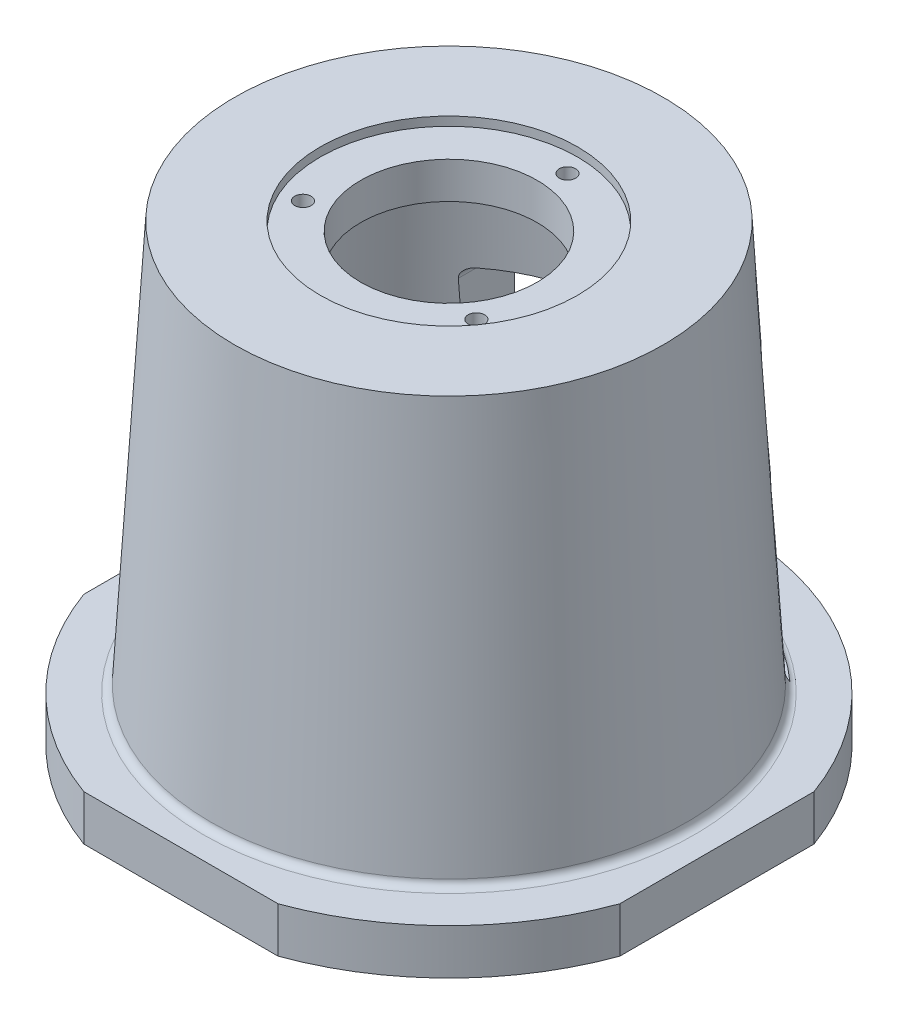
ISO-10303-21;
HEADER;
FILE_DESCRIPTION(('STEP AP214'),'2;1');
FILE_NAME('part.step','',(''),(''),'','','');
FILE_SCHEMA(('AUTOMOTIVE_DESIGN { 1 0 10303 214 1 1 1 1 }'));
ENDSEC;
DATA;
#1=APPLICATION_CONTEXT('core data for automotive mechanical design processes');
#2=APPLICATION_PROTOCOL_DEFINITION('international standard','automotive_design',2000,#1);
#3=PRODUCT_CONTEXT('',#1,'mechanical');
#4=PRODUCT('Part','Part','',(#3));
#5=PRODUCT_RELATED_PRODUCT_CATEGORY('part','',(#4));
#6=PRODUCT_DEFINITION_FORMATION('','',#4);
#7=PRODUCT_DEFINITION_CONTEXT('part definition',#1,'design');
#8=PRODUCT_DEFINITION('design','',#6,#7);
#9=PRODUCT_DEFINITION_SHAPE('','',#8);
#10=(LENGTH_UNIT() NAMED_UNIT(*) SI_UNIT(.MILLI.,.METRE.));
#11=(NAMED_UNIT(*) PLANE_ANGLE_UNIT() SI_UNIT($,.RADIAN.));
#12=(NAMED_UNIT(*) SI_UNIT($,.STERADIAN.) SOLID_ANGLE_UNIT());
#13=UNCERTAINTY_MEASURE_WITH_UNIT(LENGTH_MEASURE(1.E-05),#10,'distance_accuracy_value','');
#14=(GEOMETRIC_REPRESENTATION_CONTEXT(3) GLOBAL_UNCERTAINTY_ASSIGNED_CONTEXT((#13)) GLOBAL_UNIT_ASSIGNED_CONTEXT((#10,
#11,#12)) REPRESENTATION_CONTEXT('',''));
#15=CARTESIAN_POINT('',(0.,0.,0.));
#16=DIRECTION('',(0.,0.,1.));
#17=DIRECTION('',(1.,0.,0.));
#18=AXIS2_PLACEMENT_3D('',#15,#16,#17);
#19=CARTESIAN_POINT('',(0.,193.732089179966,0.));
#20=DIRECTION('',(0.,1.,0.));
#21=DIRECTION('',(0.,0.,1.));
#22=AXIS2_PLACEMENT_3D('',#19,#20,#21);
#23=CYLINDRICAL_SURFACE('',#22,113.);
#24=DIRECTION('',(0.,1.,0.));
#25=VECTOR('',#24,1.);
#26=CARTESIAN_POINT('',(106.239117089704,0.,38.5000000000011));
#27=LINE('',#26,#25);
#28=CARTESIAN_POINT('',(106.239117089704,0.,38.5000000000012));
#29=VERTEX_POINT('',#28);
#30=CARTESIAN_POINT('',(106.239117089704,18.,38.5000000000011));
#31=VERTEX_POINT('',#30);
#32=EDGE_CURVE('E291',#29,#31,#27,.T.);
#33=ORIENTED_EDGE('',*,*,#32,.T.);
#34=CARTESIAN_POINT('',(0.,18.,0.));
#35=DIRECTION('',(0.,1.,0.));
#36=DIRECTION('',(0.,0.,1.));
#37=AXIS2_PLACEMENT_3D('',#34,#35,#36);
#38=CIRCLE('',#37,113.);
#39=CARTESIAN_POINT('',(38.5,18.,106.239117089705));
#40=VERTEX_POINT('',#39);
#41=EDGE_CURVE('E329',#40,#31,#38,.T.);
#42=ORIENTED_EDGE('',*,*,#41,.F.);
#43=DIRECTION('',(0.,1.,0.));
#44=VECTOR('',#43,1.);
#45=CARTESIAN_POINT('',(38.5,0.,106.239117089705));
#46=LINE('',#45,#44);
#47=CARTESIAN_POINT('',(38.5,0.,106.239117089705));
#48=VERTEX_POINT('',#47);
#49=EDGE_CURVE('E312',#48,#40,#46,.T.);
#50=ORIENTED_EDGE('',*,*,#49,.F.);
#51=CARTESIAN_POINT('',(0.,0.,0.));
#52=DIRECTION('',(0.,1.,0.));
#53=DIRECTION('',(0.,0.,1.));
#54=AXIS2_PLACEMENT_3D('',#51,#52,#53);
#55=CIRCLE('',#54,113.);
#56=EDGE_CURVE('E318',#48,#29,#55,.T.);
#57=ORIENTED_EDGE('',*,*,#56,.T.);
#58=EDGE_LOOP('',(#33,#42,#50,#57));
#59=FACE_BOUND('',#58,.T.);
#60=ADVANCED_FACE('F38',(#59),#23,.T.);
#61=DIRECTION('',(0.,1.,0.));
#62=VECTOR('',#61,1.);
#63=CARTESIAN_POINT('',(106.239117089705,0.,-38.4999999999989));
#64=LINE('',#63,#62);
#65=CARTESIAN_POINT('',(106.239117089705,0.,-38.4999999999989));
#66=VERTEX_POINT('',#65);
#67=CARTESIAN_POINT('',(106.239117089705,18.,-38.4999999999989));
#68=VERTEX_POINT('',#67);
#69=EDGE_CURVE('E290',#66,#68,#64,.T.);
#70=ORIENTED_EDGE('',*,*,#69,.F.);
#71=CARTESIAN_POINT('',(-106.239117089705,0.,-38.5000000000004));
#72=VERTEX_POINT('',#71);
#73=EDGE_CURVE('E322',#66,#72,#55,.T.);
#74=ORIENTED_EDGE('',*,*,#73,.T.);
#75=DIRECTION('',(0.,1.,0.));
#76=VECTOR('',#75,1.);
#77=CARTESIAN_POINT('',(-106.239117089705,0.,-38.5000000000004));
#78=LINE('',#77,#76);
#79=CARTESIAN_POINT('',(-106.239117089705,18.,-38.5000000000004));
#80=VERTEX_POINT('',#79);
#81=EDGE_CURVE('E302',#72,#80,#78,.T.);
#82=ORIENTED_EDGE('',*,*,#81,.T.);
#83=EDGE_CURVE('E333',#68,#80,#38,.T.);
#84=ORIENTED_EDGE('',*,*,#83,.F.);
#85=EDGE_LOOP('',(#70,#74,#82,#84));
#86=FACE_BOUND('',#85,.T.);
#87=ADVANCED_FACE('F411',(#86),#23,.T.);
#88=DIRECTION('',(0.,1.,0.));
#89=VECTOR('',#88,1.);
#90=CARTESIAN_POINT('',(-106.239117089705,0.,38.4999999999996));
#91=LINE('',#90,#89);
#92=CARTESIAN_POINT('',(-106.239117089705,0.,38.4999999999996));
#93=VERTEX_POINT('',#92);
#94=CARTESIAN_POINT('',(-106.239117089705,18.,38.4999999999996));
#95=VERTEX_POINT('',#94);
#96=EDGE_CURVE('E301',#93,#95,#91,.T.);
#97=ORIENTED_EDGE('',*,*,#96,.F.);
#98=CARTESIAN_POINT('',(-38.5000000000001,0.,106.239117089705));
#99=VERTEX_POINT('',#98);
#100=EDGE_CURVE('E316',#93,#99,#55,.T.);
#101=ORIENTED_EDGE('',*,*,#100,.T.);
#102=DIRECTION('',(0.,1.,0.));
#103=VECTOR('',#102,1.);
#104=CARTESIAN_POINT('',(-38.5,0.,106.239117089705));
#105=LINE('',#104,#103);
#106=CARTESIAN_POINT('',(-38.5,18.,106.239117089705));
#107=VERTEX_POINT('',#106);
#108=EDGE_CURVE('E313',#99,#107,#105,.T.);
#109=ORIENTED_EDGE('',*,*,#108,.T.);
#110=EDGE_CURVE('E328',#95,#107,#38,.T.);
#111=ORIENTED_EDGE('',*,*,#110,.F.);
#112=EDGE_LOOP('',(#97,#101,#109,#111));
#113=FACE_BOUND('',#112,.T.);
#114=ADVANCED_FACE('F40',(#113),#23,.T.);
#115=CARTESIAN_POINT('',(-113.,18.,0.));
#116=DIRECTION('',(0.,1.,0.));
#117=DIRECTION('',(0.,0.,1.));
#118=AXIS2_PLACEMENT_3D('',#115,#116,#117);
#119=PLANE('',#118);
#120=DIRECTION('',(0.,0.,1.));
#121=VECTOR('',#120,1.);
#122=CARTESIAN_POINT('',(106.239117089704,18.,38.5000000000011));
#123=LINE('',#122,#121);
#124=EDGE_CURVE('E285',#68,#31,#123,.T.);
#125=ORIENTED_EDGE('',*,*,#124,.F.);
#126=ORIENTED_EDGE('',*,*,#83,.T.);
#127=DIRECTION('',(0.,0.,-1.));
#128=VECTOR('',#127,1.);
#129=CARTESIAN_POINT('',(-106.239117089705,18.,-38.5000000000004));
#130=LINE('',#129,#128);
#131=EDGE_CURVE('E294',#95,#80,#130,.T.);
#132=ORIENTED_EDGE('',*,*,#131,.F.);
#133=ORIENTED_EDGE('',*,*,#110,.T.);
#134=DIRECTION('',(-1.,0.,0.));
#135=VECTOR('',#134,1.);
#136=CARTESIAN_POINT('',(-38.5,18.,106.239117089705));
#137=LINE('',#136,#135);
#138=EDGE_CURVE('E305',#40,#107,#137,.T.);
#139=ORIENTED_EDGE('',*,*,#138,.F.);
#140=ORIENTED_EDGE('',*,*,#41,.T.);
#141=EDGE_LOOP('',(#125,#126,#132,#133,#139,#140));
#142=FACE_BOUND('',#141,.T.);
#143=CARTESIAN_POINT('',(0.,18.,0.));
#144=DIRECTION('',(0.,1.,0.));
#145=DIRECTION('',(0.,0.,1.));
#146=AXIS2_PLACEMENT_3D('',#143,#144,#145);
#147=CIRCLE('',#146,97.358127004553);
#148=CARTESIAN_POINT('',(0.,18.,97.358127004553));
#149=VERTEX_POINT('',#148);
#150=EDGE_CURVE('E169',#149,#149,#147,.F.);
#151=ORIENTED_EDGE('',*,*,#150,.T.);
#152=EDGE_LOOP('',(#151));
#153=FACE_BOUND('',#152,.T.);
#154=ADVANCED_FACE('F418',(#142,#153),#119,.T.);
#155=CARTESIAN_POINT('',(0.,180.,0.));
#156=DIRECTION('',(0.,-1.,0.));
#157=DIRECTION('',(0.,0.,-1.));
#158=AXIS2_PLACEMENT_3D('',#155,#156,#157);
#159=CONICAL_SURFACE('',#158,85.,0.0587558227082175);
#160=CARTESIAN_POINT('',(-73.9770731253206,-118.110014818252,-71.));
#161=CARTESIAN_POINT('',(-73.3866837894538,-110.868971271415,-71.));
#162=CARTESIAN_POINT('',(-72.7929481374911,-103.628200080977,-71.));
#163=CARTESIAN_POINT('',(-71.598230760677,-89.1472537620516,-71.));
#164=CARTESIAN_POINT('',(-70.997249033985,-81.9070786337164,-71.));
#165=CARTESIAN_POINT('',(-69.7874858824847,-67.4273736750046,-71.));
#166=CARTESIAN_POINT('',(-69.1787044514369,-60.1878438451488,-71.));
#167=CARTESIAN_POINT('',(-67.9526949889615,-45.7095005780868,-71.));
#168=CARTESIAN_POINT('',(-67.3354669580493,-38.4706871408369,-71.));
#169=CARTESIAN_POINT('',(-65.4696235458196,-16.7501186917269,-71.));
#170=CARTESIAN_POINT('',(-64.2072907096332,-2.26953626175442,-71.));
#171=CARTESIAN_POINT('',(-62.28112610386,19.448450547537,-71.));
#172=CARTESIAN_POINT('',(-61.6336263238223,26.6873058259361,-71.));
#173=CARTESIAN_POINT('',(-60.3266419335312,41.1639338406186,-71.));
#174=CARTESIAN_POINT('',(-59.6671573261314,48.4017065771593,-71.));
#175=CARTESIAN_POINT('',(-58.3349819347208,62.8759566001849,-71.));
#176=CARTESIAN_POINT('',(-57.662291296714,70.1124339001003,-71.));
#177=CARTESIAN_POINT('',(-56.3022528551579,84.5840096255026,-71.));
#178=CARTESIAN_POINT('',(-55.6149050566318,91.8191080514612,-71.));
#179=CARTESIAN_POINT('',(-54.2238580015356,106.287697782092,-71.));
#180=CARTESIAN_POINT('',(-53.52015882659,113.521189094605,-71.));
#181=CARTESIAN_POINT('',(-52.0943850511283,127.986362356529,-71.));
#182=CARTESIAN_POINT('',(-51.3723104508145,135.218044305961,-71.));
#183=CARTESIAN_POINT('',(-49.9075280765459,149.677565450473,-71.));
#184=CARTESIAN_POINT('',(-49.1648253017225,156.90540515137,-71.));
#185=CARTESIAN_POINT('',(-47.6556516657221,171.358608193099,-71.));
#186=CARTESIAN_POINT('',(-46.8891807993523,178.583971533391,-71.));
#187=CARTESIAN_POINT('',(-45.3287636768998,193.031908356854,-71.));
#188=CARTESIAN_POINT('',(-44.5348167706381,200.254481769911,-71.));
#189=CARTESIAN_POINT('',(-42.9148142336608,214.696035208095,-71.));
#190=CARTESIAN_POINT('',(-42.0887586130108,221.915015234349,-71.));
#191=CARTESIAN_POINT('',(-40.6200154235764,234.456601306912,-71.));
#192=CARTESIAN_POINT('',(-39.9860277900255,239.780225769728,-71.));
#193=CARTESIAN_POINT('',(-38.6941231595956,250.424561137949,-71.));
#194=CARTESIAN_POINT('',(-38.0362062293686,255.745272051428,-71.));
#195=CARTESIAN_POINT('',(-36.6925806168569,266.382816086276,-71.));
#196=CARTESIAN_POINT('',(-36.006873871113,271.699649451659,-71.));
#197=CARTESIAN_POINT('',(-34.6025680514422,282.32903017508,-71.));
#198=CARTESIAN_POINT('',(-33.8839686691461,287.641577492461,-71.));
#199=CARTESIAN_POINT('',(-32.4069489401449,298.263382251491,-71.));
#200=CARTESIAN_POINT('',(-31.648512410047,303.572637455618,-71.));
#201=CARTESIAN_POINT('',(-30.4742632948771,311.531055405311,-71.));
#202=CARTESIAN_POINT('',(-30.0767523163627,314.182922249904,-71.));
#203=CARTESIAN_POINT('',(-29.2679930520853,319.484558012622,-71.));
#204=CARTESIAN_POINT('',(-28.8567447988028,322.134326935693,-71.));
#205=CARTESIAN_POINT('',(-28.0186192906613,327.432010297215,-71.));
#206=CARTESIAN_POINT('',(-27.5917385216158,330.079924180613,-71.));
#207=CARTESIAN_POINT('',(-26.7202068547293,335.372811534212,-71.));
#208=CARTESIAN_POINT('',(-26.2755560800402,338.01778502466,-71.));
#209=CARTESIAN_POINT('',(-25.3656584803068,343.304433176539,-71.));
#210=CARTESIAN_POINT('',(-24.9004098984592,345.94610753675,-71.));
#211=CARTESIAN_POINT('',(-24.1844132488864,349.90537075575,-71.));
#212=CARTESIAN_POINT('',(-23.9427239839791,351.22459998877,-71.));
#213=CARTESIAN_POINT('',(-23.4527283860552,353.861834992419,-71.));
#214=CARTESIAN_POINT('',(-23.2044220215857,355.179840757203,-71.));
#215=CARTESIAN_POINT('',(-22.9525195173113,356.497163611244,-71.));
#216=B_SPLINE_CURVE_WITH_KNOTS('',3,(#160,#161,#162,#163,#164,#165,#166,#167,#168,#169,#170,
#171,#172,#173,#174,#175,#176,#177,#178,#179,#180,#181,#182,#183,#184,#185,#186,#187,#188,#189,
#190,#191,#192,#193,#194,#195,#196,#197,#198,#199,#200,#201,#202,#203,#204,#205,#206,#207,#208,
#209,#210,#211,#212,#213,#214,#215),.UNSPECIFIED.,.F.,.F.,(4,2,2,2,2,2,2,2,2,2,2,2,2,2,2,2,2,2,
2,2,2,2,2,2,2,2,2,4),(0.,21.7952158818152,43.5904373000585,65.3856761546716,87.1809136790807,
130.787346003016,152.590607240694,174.393863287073,196.196878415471,217.999886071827,
239.802784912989,261.605683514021,283.403343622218,305.201008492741,326.999189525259,
348.797363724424,364.881045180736,380.964681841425,397.047199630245,413.129868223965,
429.219121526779,437.263576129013,445.308011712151,453.354266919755,461.400466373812,
469.447353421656,473.470895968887,477.494457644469),.UNSPECIFIED.);
#217=CARTESIAN_POINT('',(-62.156521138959,20.823833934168,-71.));
#218=VERTEX_POINT('',#217);
#219=CARTESIAN_POINT('',(-48.4240210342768,164.,-71.));
#220=VERTEX_POINT('',#219);
#221=EDGE_CURVE('E182',#218,#220,#216,.T.);
#222=ORIENTED_EDGE('',*,*,#221,.F.);
#223=CARTESIAN_POINT('',(0.,20.8238339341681,0.));
#224=DIRECTION('',(0.,-1.,0.));
#225=DIRECTION('',(0.,0.,-1.));
#226=AXIS2_PLACEMENT_3D('',#223,#224,#225);
#227=CIRCLE('',#226,94.3633038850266);
#228=CARTESIAN_POINT('',(62.1565211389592,20.8238339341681,-71.));
#229=VERTEX_POINT('',#228);
#230=EDGE_CURVE('E181',#218,#229,#227,.F.);
#231=ORIENTED_EDGE('',*,*,#230,.T.);
#232=CARTESIAN_POINT('',(73.9770731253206,-118.110014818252,-71.));
#233=CARTESIAN_POINT('',(73.3866837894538,-110.868971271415,-71.));
#234=CARTESIAN_POINT('',(72.7929481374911,-103.628200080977,-71.));
#235=CARTESIAN_POINT('',(71.598230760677,-89.1472537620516,-71.));
#236=CARTESIAN_POINT('',(70.997249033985,-81.9070786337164,-71.));
#237=CARTESIAN_POINT('',(69.7874858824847,-67.4273736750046,-71.));
#238=CARTESIAN_POINT('',(69.1787044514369,-60.1878438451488,-71.));
#239=CARTESIAN_POINT('',(67.9526949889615,-45.7095005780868,-71.));
#240=CARTESIAN_POINT('',(67.3354669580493,-38.4706871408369,-71.));
#241=CARTESIAN_POINT('',(65.4696235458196,-16.7501186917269,-71.));
#242=CARTESIAN_POINT('',(64.2072907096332,-2.26953626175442,-71.));
#243=CARTESIAN_POINT('',(62.28112610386,19.448450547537,-71.));
#244=CARTESIAN_POINT('',(61.6336263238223,26.6873058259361,-71.));
#245=CARTESIAN_POINT('',(60.3266419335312,41.1639338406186,-71.));
#246=CARTESIAN_POINT('',(59.6671573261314,48.4017065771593,-71.));
#247=CARTESIAN_POINT('',(58.3349819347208,62.8759566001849,-71.));
#248=CARTESIAN_POINT('',(57.662291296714,70.1124339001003,-71.));
#249=CARTESIAN_POINT('',(56.3022528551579,84.5840096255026,-71.));
#250=CARTESIAN_POINT('',(55.6149050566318,91.8191080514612,-71.));
#251=CARTESIAN_POINT('',(54.2238580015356,106.287697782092,-71.));
#252=CARTESIAN_POINT('',(53.52015882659,113.521189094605,-71.));
#253=CARTESIAN_POINT('',(52.0943850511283,127.986362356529,-71.));
#254=CARTESIAN_POINT('',(51.3723104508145,135.218044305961,-71.));
#255=CARTESIAN_POINT('',(49.9075280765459,149.677565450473,-71.));
#256=CARTESIAN_POINT('',(49.1648253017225,156.90540515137,-71.));
#257=CARTESIAN_POINT('',(47.6556516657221,171.358608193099,-71.));
#258=CARTESIAN_POINT('',(46.8891807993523,178.583971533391,-71.));
#259=CARTESIAN_POINT('',(45.3287636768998,193.031908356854,-71.));
#260=CARTESIAN_POINT('',(44.5348167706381,200.254481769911,-71.));
#261=CARTESIAN_POINT('',(42.9148142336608,214.696035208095,-71.));
#262=CARTESIAN_POINT('',(42.0887586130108,221.915015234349,-71.));
#263=CARTESIAN_POINT('',(40.6200154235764,234.456601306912,-71.));
#264=CARTESIAN_POINT('',(39.9860277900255,239.780225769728,-71.));
#265=CARTESIAN_POINT('',(38.6941231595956,250.424561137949,-71.));
#266=CARTESIAN_POINT('',(38.0362062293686,255.745272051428,-71.));
#267=CARTESIAN_POINT('',(36.6925806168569,266.382816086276,-71.));
#268=CARTESIAN_POINT('',(36.006873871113,271.699649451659,-71.));
#269=CARTESIAN_POINT('',(34.6025680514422,282.32903017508,-71.));
#270=CARTESIAN_POINT('',(33.8839686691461,287.641577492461,-71.));
#271=CARTESIAN_POINT('',(32.4069489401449,298.263382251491,-71.));
#272=CARTESIAN_POINT('',(31.648512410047,303.572637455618,-71.));
#273=CARTESIAN_POINT('',(30.4742632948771,311.531055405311,-71.));
#274=CARTESIAN_POINT('',(30.0767523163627,314.182922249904,-71.));
#275=CARTESIAN_POINT('',(29.2679930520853,319.484558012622,-71.));
#276=CARTESIAN_POINT('',(28.8567447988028,322.134326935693,-71.));
#277=CARTESIAN_POINT('',(28.0186192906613,327.432010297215,-71.));
#278=CARTESIAN_POINT('',(27.5917385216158,330.079924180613,-71.));
#279=CARTESIAN_POINT('',(26.7202068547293,335.372811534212,-71.));
#280=CARTESIAN_POINT('',(26.2755560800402,338.01778502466,-71.));
#281=CARTESIAN_POINT('',(25.3656584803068,343.304433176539,-71.));
#282=CARTESIAN_POINT('',(24.9004098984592,345.94610753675,-71.));
#283=CARTESIAN_POINT('',(24.1844132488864,349.90537075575,-71.));
#284=CARTESIAN_POINT('',(23.9427239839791,351.22459998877,-71.));
#285=CARTESIAN_POINT('',(23.4527283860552,353.861834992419,-71.));
#286=CARTESIAN_POINT('',(23.2044220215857,355.179840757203,-71.));
#287=CARTESIAN_POINT('',(22.9525195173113,356.497163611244,-71.));
#288=B_SPLINE_CURVE_WITH_KNOTS('',3,(#232,#233,#234,#235,#236,#237,#238,#239,#240,#241,#242,
#243,#244,#245,#246,#247,#248,#249,#250,#251,#252,#253,#254,#255,#256,#257,#258,#259,#260,#261,
#262,#263,#264,#265,#266,#267,#268,#269,#270,#271,#272,#273,#274,#275,#276,#277,#278,#279,#280,
#281,#282,#283,#284,#285,#286,#287),.UNSPECIFIED.,.F.,.F.,(4,2,2,2,2,2,2,2,2,2,2,2,2,2,2,2,2,2,
2,2,2,2,2,2,2,2,2,4),(0.,21.7952158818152,43.5904373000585,65.3856761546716,87.1809136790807,
130.787346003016,152.590607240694,174.393863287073,196.196878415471,217.999886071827,
239.802784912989,261.605683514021,283.403343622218,305.201008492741,326.999189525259,
348.797363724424,364.881045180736,380.964681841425,397.047199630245,413.129868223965,
429.219121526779,437.263576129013,445.308011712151,453.354266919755,461.400466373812,
469.447353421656,473.470895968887,477.494457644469),.UNSPECIFIED.);
#289=CARTESIAN_POINT('',(48.4240210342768,164.,-71.));
#290=VERTEX_POINT('',#289);
#291=EDGE_CURVE('E183',#290,#229,#288,.F.);
#292=ORIENTED_EDGE('',*,*,#291,.F.);
#293=CARTESIAN_POINT('',(0.,164.,0.));
#294=DIRECTION('',(0.,1.,0.));
#295=DIRECTION('',(0.,0.,1.));
#296=AXIS2_PLACEMENT_3D('',#293,#294,#295);
#297=CIRCLE('',#296,85.9411764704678);
#298=EDGE_CURVE('E12',#220,#290,#297,.F.);
#299=ORIENTED_EDGE('',*,*,#298,.F.);
#300=EDGE_LOOP('',(#222,#231,#292,#299));
#301=FACE_BOUND('',#300,.T.);
#302=CARTESIAN_POINT('',(0.,180.,0.));
#303=DIRECTION('',(0.,1.,0.));
#304=DIRECTION('',(0.,0.,1.));
#305=AXIS2_PLACEMENT_3D('',#302,#303,#304);
#306=CIRCLE('',#305,85.);
#307=CARTESIAN_POINT('',(0.,180.,85.));
#308=VERTEX_POINT('',#307);
#309=EDGE_CURVE('E325',#308,#308,#306,.T.);
#310=ORIENTED_EDGE('',*,*,#309,.F.);
#311=EDGE_LOOP('',(#310));
#312=FACE_BOUND('',#311,.T.);
#313=ADVANCED_FACE('F423',(#301,#312),#159,.T.);
#314=CARTESIAN_POINT('',(-85.,180.,0.));
#315=DIRECTION('',(0.,1.,0.));
#316=DIRECTION('',(0.,0.,1.));
#317=AXIS2_PLACEMENT_3D('',#314,#315,#316);
#318=PLANE('',#317);
#319=CARTESIAN_POINT('',(0.,180.,0.));
#320=DIRECTION('',(0.,1.,0.));
#321=DIRECTION('',(0.,0.,1.));
#322=AXIS2_PLACEMENT_3D('',#319,#320,#321);
#323=CIRCLE('',#322,51.);
#324=CARTESIAN_POINT('',(0.,180.,51.));
#325=VERTEX_POINT('',#324);
#326=EDGE_CURVE('E274',#325,#325,#323,.T.);
#327=ORIENTED_EDGE('',*,*,#326,.F.);
#328=EDGE_LOOP('',(#327));
#329=FACE_BOUND('',#328,.T.);
#330=ORIENTED_EDGE('',*,*,#309,.T.);
#331=EDGE_LOOP('',(#330));
#332=FACE_BOUND('',#331,.T.);
#333=ADVANCED_FACE('F470',(#329,#332),#318,.T.);
#334=CARTESIAN_POINT('',(-63.4705882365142,162.,0.));
#335=DIRECTION('',(0.,-1.,0.));
#336=DIRECTION('',(0.,0.,-1.));
#337=AXIS2_PLACEMENT_3D('',#334,#335,#336);
#338=PLANE('',#337);
#339=CARTESIAN_POINT('',(3.6481564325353,162.,-43.3467525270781));
#340=DIRECTION('',(0.,-1.,0.));
#341=DIRECTION('',(0.,0.,-1.));
#342=AXIS2_PLACEMENT_3D('',#339,#340,#341);
#343=CIRCLE('',#342,3.25);
#344=CARTESIAN_POINT('',(3.6481564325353,162.,-46.5967525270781));
#345=VERTEX_POINT('',#344);
#346=EDGE_CURVE('E247',#345,#345,#343,.T.);
#347=ORIENTED_EDGE('',*,*,#346,.F.);
#348=EDGE_LOOP('',(#347));
#349=FACE_BOUND('',#348,.T.);
#350=CARTESIAN_POINT('',(-39.3634670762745,162.,18.513980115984));
#351=DIRECTION('',(0.,-1.,0.));
#352=DIRECTION('',(0.,0.,-1.));
#353=AXIS2_PLACEMENT_3D('',#350,#351,#352);
#354=CIRCLE('',#353,3.25);
#355=CARTESIAN_POINT('',(-39.3634670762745,162.,15.263980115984));
#356=VERTEX_POINT('',#355);
#357=EDGE_CURVE('E241',#356,#356,#354,.T.);
#358=ORIENTED_EDGE('',*,*,#357,.F.);
#359=EDGE_LOOP('',(#358));
#360=FACE_BOUND('',#359,.T.);
#361=CARTESIAN_POINT('',(35.7153106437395,162.,24.8327724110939));
#362=DIRECTION('',(0.,-1.,0.));
#363=DIRECTION('',(0.,0.,-1.));
#364=AXIS2_PLACEMENT_3D('',#361,#362,#363);
#365=CIRCLE('',#364,3.25);
#366=CARTESIAN_POINT('',(35.7153106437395,162.,21.5827724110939));
#367=VERTEX_POINT('',#366);
#368=EDGE_CURVE('E233',#367,#367,#365,.T.);
#369=ORIENTED_EDGE('',*,*,#368,.F.);
#370=EDGE_LOOP('',(#369));
#371=FACE_BOUND('',#370,.T.);
#372=CARTESIAN_POINT('',(0.,162.,0.));
#373=DIRECTION('',(0.,1.,0.));
#374=DIRECTION('',(0.,0.,1.));
#375=AXIS2_PLACEMENT_3D('',#372,#373,#374);
#376=CIRCLE('',#375,35.);
#377=CARTESIAN_POINT('',(0.,162.,35.));
#378=VERTEX_POINT('',#377);
#379=EDGE_CURVE('E276',#378,#378,#376,.T.);
#380=ORIENTED_EDGE('',*,*,#379,.T.);
#381=EDGE_LOOP('',(#380));
#382=FACE_BOUND('',#381,.T.);
#383=CARTESIAN_POINT('',(0.,162.,0.));
#384=DIRECTION('',(0.,-1.,0.));
#385=DIRECTION('',(0.,0.,-1.));
#386=AXIS2_PLACEMENT_3D('',#383,#384,#385);
#387=CIRCLE('',#386,60.6418729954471);
#388=CARTESIAN_POINT('',(0.,162.,-60.6418729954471));
#389=VERTEX_POINT('',#388);
#390=EDGE_CURVE('E336',#389,#389,#387,.T.);
#391=ORIENTED_EDGE('',*,*,#390,.T.);
#392=EDGE_LOOP('',(#391));
#393=FACE_BOUND('',#392,.T.);
#394=ADVANCED_FACE('F467',(#349,#360,#371,#382,#393),#338,.T.);
#395=CARTESIAN_POINT('',(0.,0.,0.));
#396=DIRECTION('',(0.,-1.,0.));
#397=DIRECTION('',(0.,0.,-1.));
#398=AXIS2_PLACEMENT_3D('',#395,#396,#397);
#399=CONICAL_SURFACE('',#398,73.,0.0587558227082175);
#400=CARTESIAN_POINT('',(-40.9998,117.499999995,-51.8331095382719));
#401=CARTESIAN_POINT('',(-41.1322337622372,117.499991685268,-51.7283624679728));
#402=CARTESIAN_POINT('',(-41.2644983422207,117.493435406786,-51.6234015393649));
#403=CARTESIAN_POINT('',(-41.5279790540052,117.467216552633,-51.4136643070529));
#404=CARTESIAN_POINT('',(-41.6591946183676,117.447547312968,-51.3088881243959));
#405=CARTESIAN_POINT('',(-41.9205913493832,117.394918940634,-51.0995515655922));
#406=CARTESIAN_POINT('',(-42.0507599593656,117.361872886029,-50.9949971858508));
#407=CARTESIAN_POINT('',(-42.3082830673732,117.282400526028,-50.787630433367));
#408=CARTESIAN_POINT('',(-42.4356382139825,117.235977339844,-50.6848176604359));
#409=CARTESIAN_POINT('',(-42.7791415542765,117.090364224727,-50.4069802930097));
#410=CARTESIAN_POINT('',(-42.9917167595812,116.977475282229,-50.2344504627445));
#411=CARTESIAN_POINT('',(-43.399772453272,116.709439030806,-49.9032279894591));
#412=CARTESIAN_POINT('',(-43.5952944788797,116.554398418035,-49.7445017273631));
#413=CARTESIAN_POINT('',(-43.9165914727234,116.244141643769,-49.4852432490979));
#414=CARTESIAN_POINT('',(-44.0476798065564,116.098386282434,-49.380009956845));
#415=CARTESIAN_POINT('',(-44.2912452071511,115.781985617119,-49.1867092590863));
#416=CARTESIAN_POINT('',(-44.4037448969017,115.611371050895,-49.0986209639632));
#417=CARTESIAN_POINT('',(-44.5862226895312,115.279876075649,-48.9592994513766));
#418=CARTESIAN_POINT('',(-44.6602121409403,115.122839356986,-48.9042798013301));
#419=CARTESIAN_POINT('',(-44.7562780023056,114.877715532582,-48.8358906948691));
#420=CARTESIAN_POINT('',(-44.7858080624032,114.794434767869,-48.8154543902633));
#421=CARTESIAN_POINT('',(-44.8395270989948,114.62512380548,-48.7796441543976));
#422=CARTESIAN_POINT('',(-44.8637185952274,114.539094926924,-48.7642678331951));
#423=CARTESIAN_POINT('',(-44.903946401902,114.374928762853,-48.7403569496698));
#424=CARTESIAN_POINT('',(-44.9206018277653,114.297027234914,-48.731237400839));
#425=CARTESIAN_POINT('',(-44.9492755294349,114.139994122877,-48.7173593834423));
#426=CARTESIAN_POINT('',(-44.9612942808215,114.060862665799,-48.7126004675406));
#427=CARTESIAN_POINT('',(-44.9806125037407,113.90148691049,-48.707524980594));
#428=CARTESIAN_POINT('',(-44.9878883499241,113.821239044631,-48.7072304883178));
#429=CARTESIAN_POINT('',(-44.9975918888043,113.660534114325,-48.7111355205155));
#430=CARTESIAN_POINT('',(-45.0000180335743,113.580076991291,-48.7153364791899));
#431=CARTESIAN_POINT('',(-44.999999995,113.4998,-48.7217827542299));
#432=B_SPLINE_CURVE_WITH_KNOTS('',3,(#400,#401,#402,#403,#404,#405,#406,#407,#408,#409,#410,
#411,#412,#413,#414,#415,#416,#417,#418,#419,#420,#421,#422,#423,#424,#425,#426,#427,#428,#429,
#430,#431),.UNSPECIFIED.,.F.,.F.,(4,2,2,2,2,2,2,2,2,2,2,2,2,2,2,4),(0.,0.50642442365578,
1.01310640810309,1.52313503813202,2.03304483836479,2.91792189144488,3.80057962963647,
4.46569782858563,5.13000049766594,5.67385942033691,5.9456533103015,6.21731864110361,
6.45761592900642,6.69788856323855,6.93934907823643,7.18088665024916),.UNSPECIFIED.);
#433=CARTESIAN_POINT('',(-41.,117.5,-51.8329513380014));
#434=VERTEX_POINT('',#433);
#435=CARTESIAN_POINT('',(-45.,113.5,-48.7217667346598));
#436=VERTEX_POINT('',#435);
#437=EDGE_CURVE('E371',#434,#436,#432,.T.);
#438=ORIENTED_EDGE('',*,*,#437,.F.);
#439=CARTESIAN_POINT('',(0.,117.5,0.));
#440=DIRECTION('',(0.,1.,0.));
#441=DIRECTION('',(-1.,0.,0.));
#442=AXIS2_PLACEMENT_3D('',#439,#440,#441);
#443=CIRCLE('',#442,66.0882352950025);
#444=CARTESIAN_POINT('',(41.,117.5,-51.8329513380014));
#445=VERTEX_POINT('',#444);
#446=EDGE_CURVE('E376',#445,#434,#443,.T.);
#447=ORIENTED_EDGE('',*,*,#446,.F.);
#448=CARTESIAN_POINT('',(44.999999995,113.4998,-48.7217827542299));
#449=CARTESIAN_POINT('',(45.0000251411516,113.588165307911,-48.7146815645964));
#450=CARTESIAN_POINT('',(44.9970814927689,113.676748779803,-48.7103083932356));
#451=CARTESIAN_POINT('',(44.985320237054,113.853593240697,-48.7070119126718));
#452=CARTESIAN_POINT('',(44.9765048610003,113.941854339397,-48.708086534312));
#453=CARTESIAN_POINT('',(44.9531426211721,114.116772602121,-48.7156485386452));
#454=CARTESIAN_POINT('',(44.9386347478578,114.203436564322,-48.7220994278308));
#455=CARTESIAN_POINT('',(44.9040836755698,114.375096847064,-48.7402159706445));
#456=CARTESIAN_POINT('',(44.884040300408,114.460093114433,-48.7518817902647));
#457=CARTESIAN_POINT('',(44.8387245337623,114.627705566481,-48.7801721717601));
#458=CARTESIAN_POINT('',(44.8134593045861,114.710324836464,-48.7967899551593));
#459=CARTESIAN_POINT('',(44.7580243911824,114.872819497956,-48.834676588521));
#460=CARTESIAN_POINT('',(44.7278528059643,114.95269381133,-48.8559472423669));
#461=CARTESIAN_POINT('',(44.6304757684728,115.187713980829,-48.9262561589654));
#462=CARTESIAN_POINT('',(44.5564346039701,115.338160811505,-48.98177453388));
#463=CARTESIAN_POINT('',(44.3679695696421,115.668743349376,-49.1264268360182));
#464=CARTESIAN_POINT('',(44.2481501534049,115.843536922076,-49.2206450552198));
#465=CARTESIAN_POINT('',(43.9890947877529,116.166131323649,-49.4269048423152));
#466=CARTESIAN_POINT('',(43.8498269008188,116.313886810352,-49.5389757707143));
#467=CARTESIAN_POINT('',(43.5113586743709,116.624254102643,-49.8125361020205));
#468=CARTESIAN_POINT('',(43.3069880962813,116.777199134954,-49.9785560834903));
#469=CARTESIAN_POINT('',(42.8814373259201,117.038744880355,-50.3239455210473));
#470=CARTESIAN_POINT('',(42.6602244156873,117.147256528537,-50.5033409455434));
#471=CARTESIAN_POINT('',(42.3178370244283,117.278721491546,-50.7799030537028));
#472=CARTESIAN_POINT('',(42.2004525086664,117.317598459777,-50.8745329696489));
#473=CARTESIAN_POINT('',(41.9635163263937,117.384170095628,-51.0650745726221));
#474=CARTESIAN_POINT('',(41.8439644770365,117.411863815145,-51.1609863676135));
#475=CARTESIAN_POINT('',(41.6040842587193,117.455992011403,-51.3529027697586));
#476=CARTESIAN_POINT('',(41.4837647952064,117.472492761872,-51.4489033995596));
#477=CARTESIAN_POINT('',(41.2422775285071,117.494493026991,-51.6410315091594));
#478=CARTESIAN_POINT('',(41.1211099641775,117.499995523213,-51.737158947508));
#479=CARTESIAN_POINT('',(40.9998,117.499999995,-51.833109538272));
#480=B_SPLINE_CURVE_WITH_KNOTS('',3,(#448,#449,#450,#451,#452,#453,#454,#455,#456,#457,#458,
#459,#460,#461,#462,#463,#464,#465,#466,#467,#468,#469,#470,#471,#472,#473,#474,#475,#476,#477,
#478,#479),.UNSPECIFIED.,.F.,.F.,(4,2,2,2,2,2,2,2,2,2,2,2,2,2,2,4),(0.,0.265857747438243,
0.531614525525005,0.795581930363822,1.05955773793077,1.32317385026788,1.5868923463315,
2.11462950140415,2.80669104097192,3.49990272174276,4.40866751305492,5.31924507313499,
5.78602579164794,6.2528460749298,6.71687760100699,7.18078331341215),.UNSPECIFIED.);
#481=CARTESIAN_POINT('',(45.,113.5,-48.7217667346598));
#482=VERTEX_POINT('',#481);
#483=EDGE_CURVE('E721',#482,#445,#480,.T.);
#484=ORIENTED_EDGE('',*,*,#483,.F.);
#485=CARTESIAN_POINT('',(45.,-100.61157976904,-64.8313390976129));
#486=CARTESIAN_POINT('',(45.,-89.4559814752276,-64.0325036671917));
#487=CARTESIAN_POINT('',(45.,-78.3007186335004,-63.2289648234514));
#488=CARTESIAN_POINT('',(45.,-55.9909676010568,-61.6111708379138));
#489=CARTESIAN_POINT('',(45.,-44.8364794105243,-60.7969156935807));
#490=CARTESIAN_POINT('',(45.,-22.5284832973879,-59.1563871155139));
#491=CARTESIAN_POINT('',(45.,-11.3749753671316,-58.330113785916));
#492=CARTESIAN_POINT('',(45.,10.9310221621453,-56.6639131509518));
#493=CARTESIAN_POINT('',(45.,22.0835117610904,-55.823985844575));
#494=CARTESIAN_POINT('',(45.,44.3873572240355,-54.1285201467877));
#495=CARTESIAN_POINT('',(45.,55.5387130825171,-53.2729816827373));
#496=CARTESIAN_POINT('',(45.,77.8400274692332,-51.5439095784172));
#497=CARTESIAN_POINT('',(45.,88.9899859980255,-50.6703759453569));
#498=CARTESIAN_POINT('',(45.,105.713722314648,-49.3443259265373));
#499=CARTESIAN_POINT('',(45.,111.288124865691,-48.8996823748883));
#500=CARTESIAN_POINT('',(45.,122.436471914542,-48.0046918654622));
#501=CARTESIAN_POINT('',(45.,128.010416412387,-47.5543449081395));
#502=CARTESIAN_POINT('',(45.,139.157809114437,-46.6474518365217));
#503=CARTESIAN_POINT('',(45.,144.731257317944,-46.1909057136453));
#504=CARTESIAN_POINT('',(45.,155.877595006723,-45.2710257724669));
#505=CARTESIAN_POINT('',(45.,161.450484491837,-44.8076919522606));
#506=CARTESIAN_POINT('',(45.,167.023065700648,-44.3406698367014));
#507=B_SPLINE_CURVE_WITH_KNOTS('',3,(#485,#486,#487,#488,#489,#490,#491,#492,#493,#494,#495,
#496,#497,#498,#499,#500,#501,#502,#503,#504,#505,#506),.UNSPECIFIED.,.F.,.F.,(4,2,2,2,2,2,2,2,
2,2,4),(0.,33.5524912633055,67.104990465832,100.657199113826,134.209410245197,167.761777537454,
201.314131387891,218.090452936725,234.866773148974,251.643116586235,268.419464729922),.UNSPECIFIED.);
#508=CARTESIAN_POINT('',(45.,22.5,-55.7899313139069));
#509=VERTEX_POINT('',#508);
#510=EDGE_CURVE('E348',#509,#482,#507,.T.);
#511=ORIENTED_EDGE('',*,*,#510,.F.);
#512=CARTESIAN_POINT('',(40.9998,18.500000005,-59.0789158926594));
#513=CARTESIAN_POINT('',(41.1389985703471,18.5000054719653,-58.9823208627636));
#514=CARTESIAN_POINT('',(41.2775846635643,18.5072522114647,-58.8848898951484));
#515=CARTESIAN_POINT('',(41.5526024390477,18.5359400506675,-58.6890736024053));
#516=CARTESIAN_POINT('',(41.6890340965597,18.5573813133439,-58.5906882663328));
#517=CARTESIAN_POINT('',(41.959627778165,18.6143420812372,-58.3930860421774));
#518=CARTESIAN_POINT('',(42.0937710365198,18.649946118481,-58.2938677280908));
#519=CARTESIAN_POINT('',(42.3579597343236,18.7350019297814,-58.0959935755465));
#520=CARTESIAN_POINT('',(42.4880052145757,18.7844535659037,-57.997337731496));
#521=CARTESIAN_POINT('',(42.8687190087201,18.9525409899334,-57.7048378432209));
#522=CARTESIAN_POINT('',(43.1122329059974,19.091386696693,-57.5128015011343));
#523=CARTESIAN_POINT('',(43.5705779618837,19.4223753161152,-57.141864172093));
#524=CARTESIAN_POINT('',(43.7854872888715,19.6143683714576,-56.9629280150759));
#525=CARTESIAN_POINT('',(44.1176345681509,19.9855523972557,-56.6781126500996));
#526=CARTESIAN_POINT('',(44.2448503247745,20.1513644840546,-56.5664005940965));
#527=CARTESIAN_POINT('',(44.4751286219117,20.5079117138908,-56.3588083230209));
#528=CARTESIAN_POINT('',(44.5782160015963,20.6986209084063,-56.2629118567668));
#529=CARTESIAN_POINT('',(44.7392612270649,21.0678084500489,-56.1071238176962));
#530=CARTESIAN_POINT('',(44.8019260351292,21.2427791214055,-56.0438781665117));
#531=CARTESIAN_POINT('',(44.877736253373,21.5141028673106,-55.9626975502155));
#532=CARTESIAN_POINT('',(44.8999673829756,21.6059651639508,-55.9379292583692));
#533=CARTESIAN_POINT('',(44.9380176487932,21.7921638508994,-55.8933128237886));
#534=CARTESIAN_POINT('',(44.9538396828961,21.8864991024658,-55.8734624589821));
#535=CARTESIAN_POINT('',(44.9774297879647,22.0670467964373,-55.8408374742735));
#536=CARTESIAN_POINT('',(44.9858666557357,22.153078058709,-55.827540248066));
#537=CARTESIAN_POINT('',(44.997160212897,22.3260745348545,-55.8053656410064));
#538=CARTESIAN_POINT('',(45.0000165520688,22.4130398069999,-55.7964885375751));
#539=CARTESIAN_POINT('',(44.999999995,22.5002,-55.7899162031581));
#540=B_SPLINE_CURVE_WITH_KNOTS('',3,(#512,#513,#514,#515,#516,#517,#518,#519,#520,#521,#522,
#523,#524,#525,#526,#527,#528,#529,#530,#531,#532,#533,#534,#535,#536,#537,#538,#539),
.UNSPECIFIED.,.F.,.F.,(4,2,2,2,2,2,2,2,2,2,2,2,2,4),(0.,0.508094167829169,1.01619416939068,
1.52737345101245,2.03854764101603,3.05245253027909,4.06352717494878,4.77187121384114,
5.47948280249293,6.06579117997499,6.35859945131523,6.65127518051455,6.9133701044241,
7.17548147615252),.UNSPECIFIED.);
#541=CARTESIAN_POINT('',(41.,18.5,-59.0787770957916));
#542=VERTEX_POINT('',#541);
#543=EDGE_CURVE('E279',#542,#509,#540,.T.);
#544=ORIENTED_EDGE('',*,*,#543,.F.);
#545=CARTESIAN_POINT('',(0.,18.5,0.));
#546=DIRECTION('',(0.,-1.,0.));
#547=DIRECTION('',(0.,0.,-1.));
#548=AXIS2_PLACEMENT_3D('',#545,#546,#547);
#549=CIRCLE('',#548,71.9117647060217);
#550=CARTESIAN_POINT('',(-41.,18.5,-59.0787770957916));
#551=VERTEX_POINT('',#550);
#552=EDGE_CURVE('E393',#551,#542,#549,.T.);
#553=ORIENTED_EDGE('',*,*,#552,.F.);
#554=CARTESIAN_POINT('',(-44.999999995,22.5002,-55.7899162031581));
#555=CARTESIAN_POINT('',(-45.0000261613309,22.4008189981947,-55.7974034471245));
#556=CARTESIAN_POINT('',(-44.996307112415,22.3016942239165,-55.807896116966));
#557=CARTESIAN_POINT('',(-44.9816500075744,22.1048411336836,-55.8345823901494));
#558=CARTESIAN_POINT('',(-44.9707184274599,22.0071116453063,-55.8507708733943));
#559=CARTESIAN_POINT('',(-44.9420204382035,21.8145148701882,-55.8884043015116));
#560=CARTESIAN_POINT('',(-44.9243086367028,21.7196310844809,-55.9098067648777));
#561=CARTESIAN_POINT('',(-44.8824332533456,21.5325757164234,-55.9575345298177));
#562=CARTESIAN_POINT('',(-44.8582684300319,21.4404046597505,-55.983860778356));
#563=CARTESIAN_POINT('',(-44.7769069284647,21.1694441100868,-56.0693961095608));
#564=CARTESIAN_POINT('',(-44.7107127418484,20.9953690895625,-56.135330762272));
#565=CARTESIAN_POINT('',(-44.5578625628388,20.6628030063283,-56.281687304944));
#566=CARTESIAN_POINT('',(-44.4711585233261,20.5043497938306,-56.362143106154));
#567=CARTESIAN_POINT('',(-44.2449807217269,20.1484814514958,-56.5665742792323));
#568=CARTESIAN_POINT('',(-44.0979117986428,19.95874283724,-56.6955543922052));
#569=CARTESIAN_POINT('',(-43.7790689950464,19.6134494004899,-56.9677386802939));
#570=CARTESIAN_POINT('',(-43.6072666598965,19.4579344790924,-57.1109591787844));
#571=CARTESIAN_POINT('',(-43.2422596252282,19.1795107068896,-57.408342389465));
#572=CARTESIAN_POINT('',(-43.048792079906,19.0570819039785,-57.562628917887));
#573=CARTESIAN_POINT('',(-42.6473035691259,18.8479285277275,-57.8759975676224));
#574=CARTESIAN_POINT('',(-42.4392886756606,18.7611891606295,-58.0350776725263));
#575=CARTESIAN_POINT('',(-42.0284757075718,18.628921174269,-58.3427745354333));
#576=CARTESIAN_POINT('',(-41.8264348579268,18.5808133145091,-58.4912923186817));
#577=CARTESIAN_POINT('',(-41.5191043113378,18.5324712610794,-58.7129216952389));
#578=CARTESIAN_POINT('',(-41.4159724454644,18.5203272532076,-58.7865908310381));
#579=CARTESIAN_POINT('',(-41.2086151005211,18.5040918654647,-58.9332968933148));
#580=CARTESIAN_POINT('',(-41.1043895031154,18.5000013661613,-59.0063337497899));
#581=CARTESIAN_POINT('',(-40.9998,18.500000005,-59.0789158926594));
#582=B_SPLINE_CURVE_WITH_KNOTS('',3,(#554,#555,#556,#557,#558,#559,#560,#561,#562,#563,#564,
#565,#566,#567,#568,#569,#570,#571,#572,#573,#574,#575,#576,#577,#578,#579,#580,#581),
.UNSPECIFIED.,.F.,.F.,(4,2,2,2,2,2,2,2,2,2,2,2,2,4),(0.,0.29882783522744,0.597387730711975,
0.893591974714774,1.18985324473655,1.77981394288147,2.37117063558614,3.18432126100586,
3.99841496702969,4.82375348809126,5.64874954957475,6.41256121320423,6.79429885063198,
7.17607822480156),.UNSPECIFIED.);
#583=CARTESIAN_POINT('',(-45.,22.5,-55.7899313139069));
#584=VERTEX_POINT('',#583);
#585=EDGE_CURVE('E387',#584,#551,#582,.T.);
#586=ORIENTED_EDGE('',*,*,#585,.F.);
#587=CARTESIAN_POINT('',(-45.,167.023065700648,-44.3406698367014));
#588=CARTESIAN_POINT('',(-45.,162.067783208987,-44.7559634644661));
#589=CARTESIAN_POINT('',(-45.,157.112256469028,-45.1683333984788));
#590=CARTESIAN_POINT('',(-45.,147.200755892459,-45.9876532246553));
#591=CARTESIAN_POINT('',(-45.,142.244782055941,-46.394603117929));
#592=CARTESIAN_POINT('',(-45.,127.376257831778,-47.6079632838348));
#593=CARTESIAN_POINT('',(-45.,117.463095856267,-48.4068847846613));
#594=CARTESIAN_POINT('',(-45.,97.6354434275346,-49.9875307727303));
#595=CARTESIAN_POINT('',(-45.,87.7209529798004,-50.7692553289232));
#596=CARTESIAN_POINT('',(-45.,67.8908032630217,-52.3177382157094));
#597=CARTESIAN_POINT('',(-45.,57.9751439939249,-53.0844965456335));
#598=CARTESIAN_POINT('',(-45.,45.5884480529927,-54.0340796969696));
#599=CARTESIAN_POINT('',(-45.,43.1178825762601,-54.2230668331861));
#600=CARTESIAN_POINT('',(-45.,38.1766906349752,-54.6002486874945));
#601=CARTESIAN_POINT('',(-45.,35.7060641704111,-54.7884434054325));
#602=CARTESIAN_POINT('',(-45.,22.0834637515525,-55.8239911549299));
#603=CARTESIAN_POINT('',(-45.,10.9309247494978,-56.6639209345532));
#604=CARTESIAN_POINT('',(-45.,-11.3751751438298,-58.3301282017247));
#605=CARTESIAN_POINT('',(-45.,-22.528736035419,-59.1564056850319));
#606=CARTESIAN_POINT('',(-45.,-44.8367363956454,-60.7969346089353));
#607=CARTESIAN_POINT('',(-45.,-55.9911758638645,-61.6111860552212));
#608=CARTESIAN_POINT('',(-45.,-78.3008250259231,-63.2289724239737));
#609=CARTESIAN_POINT('',(-45.,-89.4560347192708,-64.0325073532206));
#610=CARTESIAN_POINT('',(-45.,-100.61157976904,-64.8313390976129));
#611=B_SPLINE_CURVE_WITH_KNOTS('',3,(#587,#588,#589,#590,#591,#592,#593,#594,#595,#596,#597,
#598,#599,#600,#601,#602,#603,#604,#605,#606,#607,#608,#609,#610),.UNSPECIFIED.,.F.,.F.,(4,2,2,
2,2,2,2,2,2,2,2,4),(0.,14.9179615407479,29.8359200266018,59.6718102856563,89.507580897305,
119.343352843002,126.776702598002,134.210053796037,167.762411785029,201.314780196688,
234.867132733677,268.419464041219),.UNSPECIFIED.);
#612=EDGE_CURVE('E168',#436,#584,#611,.T.);
#613=ORIENTED_EDGE('',*,*,#612,.F.);
#614=EDGE_LOOP('',(#438,#447,#484,#511,#544,#553,#586,#613));
#615=FACE_BOUND('',#614,.T.);
#616=CARTESIAN_POINT('',(0.,159.176166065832,0.));
#617=DIRECTION('',(0.,-1.,0.));
#618=DIRECTION('',(0.,0.,-1.));
#619=AXIS2_PLACEMENT_3D('',#616,#617,#618);
#620=CIRCLE('',#619,63.6366961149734);
#621=CARTESIAN_POINT('',(0.,159.176166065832,-63.6366961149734));
#622=VERTEX_POINT('',#621);
#623=EDGE_CURVE('E332',#622,#622,#620,.F.);
#624=ORIENTED_EDGE('',*,*,#623,.T.);
#625=EDGE_LOOP('',(#624));
#626=FACE_BOUND('',#625,.T.);
#627=CARTESIAN_POINT('',(0.,0.,0.));
#628=DIRECTION('',(0.,1.,0.));
#629=DIRECTION('',(0.,0.,1.));
#630=AXIS2_PLACEMENT_3D('',#627,#628,#629);
#631=CIRCLE('',#630,73.);
#632=CARTESIAN_POINT('',(0.,0.,73.));
#633=VERTEX_POINT('',#632);
#634=EDGE_CURVE('E321',#633,#633,#631,.T.);
#635=ORIENTED_EDGE('',*,*,#634,.F.);
#636=EDGE_LOOP('',(#635));
#637=FACE_BOUND('',#636,.T.);
#638=ADVANCED_FACE('F354',(#615,#626,#637),#399,.F.);
#639=CARTESIAN_POINT('',(-113.,0.,0.));
#640=DIRECTION('',(0.,-1.,0.));
#641=DIRECTION('',(0.,0.,-1.));
#642=AXIS2_PLACEMENT_3D('',#639,#640,#641);
#643=PLANE('',#642);
#644=DIRECTION('',(0.,0.,1.));
#645=VECTOR('',#644,1.);
#646=CARTESIAN_POINT('',(106.239117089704,0.,38.5000000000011));
#647=LINE('',#646,#645);
#648=EDGE_CURVE('E287',#66,#29,#647,.T.);
#649=ORIENTED_EDGE('',*,*,#648,.T.);
#650=ORIENTED_EDGE('',*,*,#56,.F.);
#651=DIRECTION('',(-1.,0.,0.));
#652=VECTOR('',#651,1.);
#653=CARTESIAN_POINT('',(-38.5,0.,106.239117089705));
#654=LINE('',#653,#652);
#655=EDGE_CURVE('E309',#48,#99,#654,.T.);
#656=ORIENTED_EDGE('',*,*,#655,.T.);
#657=ORIENTED_EDGE('',*,*,#100,.F.);
#658=DIRECTION('',(0.,0.,-1.));
#659=VECTOR('',#658,1.);
#660=CARTESIAN_POINT('',(-106.239117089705,0.,-38.5000000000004));
#661=LINE('',#660,#659);
#662=EDGE_CURVE('E298',#93,#72,#661,.T.);
#663=ORIENTED_EDGE('',*,*,#662,.T.);
#664=ORIENTED_EDGE('',*,*,#73,.F.);
#665=EDGE_LOOP('',(#649,#650,#656,#657,#663,#664));
#666=FACE_BOUND('',#665,.T.);
#667=ORIENTED_EDGE('',*,*,#634,.T.);
#668=EDGE_LOOP('',(#667));
#669=FACE_BOUND('',#668,.T.);
#670=ADVANCED_FACE('F432',(#666,#669),#643,.T.);
#671=CARTESIAN_POINT('',(0.,159.,0.));
#672=DIRECTION('',(0.,-1.,0.));
#673=DIRECTION('',(0.,0.,-1.));
#674=AXIS2_PLACEMENT_3D('',#671,#672,#673);
#675=TOROIDAL_SURFACE('',#674,60.6418729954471,3.);
#676=ORIENTED_EDGE('',*,*,#390,.F.);
#677=EDGE_LOOP('',(#676));
#678=FACE_BOUND('',#677,.T.);
#679=ORIENTED_EDGE('',*,*,#623,.F.);
#680=EDGE_LOOP('',(#679));
#681=FACE_BOUND('',#680,.T.);
#682=ADVANCED_FACE('F455',(#678,#681),#675,.F.);
#683=CARTESIAN_POINT('',(0.,21.,0.));
#684=DIRECTION('',(0.,1.,0.));
#685=DIRECTION('',(0.,0.,1.));
#686=AXIS2_PLACEMENT_3D('',#683,#684,#685);
#687=TOROIDAL_SURFACE('',#686,97.358127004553,3.);
#688=ORIENTED_EDGE('',*,*,#150,.F.);
#689=EDGE_LOOP('',(#688));
#690=FACE_BOUND('',#689,.T.);
#691=ORIENTED_EDGE('',*,*,#230,.F.);
#692=CARTESIAN_POINT('',(-70.8186906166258,20.3242923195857,-71.));
#693=CARTESIAN_POINT('',(-70.8570525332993,20.4415109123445,-71.));
#694=CARTESIAN_POINT('',(-70.8859066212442,20.5620093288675,-71.));
#695=CARTESIAN_POINT('',(-70.922515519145,20.8062714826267,-71.));
#696=CARTESIAN_POINT('',(-70.9302503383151,20.930038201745,-71.));
#697=CARTESIAN_POINT('',(-70.9240100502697,21.1770181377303,-71.));
#698=CARTESIAN_POINT('',(-70.910037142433,21.300231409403,-71.));
#699=CARTESIAN_POINT('',(-70.8614157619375,21.542446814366,-71.));
#700=CARTESIAN_POINT('',(-70.8267663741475,21.6614487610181,-71.));
#701=CARTESIAN_POINT('',(-70.739330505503,21.8917052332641,-71.));
#702=CARTESIAN_POINT('',(-70.6866511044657,22.0030009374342,-71.));
#703=CARTESIAN_POINT('',(-70.5659125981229,22.2168449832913,-71.));
#704=CARTESIAN_POINT('',(-70.4978462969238,22.3193892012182,-71.));
#705=CARTESIAN_POINT('',(-70.3131019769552,22.5621306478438,-71.));
#706=CARTESIAN_POINT('',(-70.1888317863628,22.6965626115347,-71.));
#707=CARTESIAN_POINT('',(-69.9203021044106,22.9437382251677,-71.));
#708=CARTESIAN_POINT('',(-69.7759971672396,23.0564311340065,-71.));
#709=CARTESIAN_POINT('',(-69.4133724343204,23.3014602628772,-71.));
#710=CARTESIAN_POINT('',(-69.1883808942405,23.4238879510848,-71.));
#711=CARTESIAN_POINT('',(-68.7219609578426,23.6316277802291,-71.));
#712=CARTESIAN_POINT('',(-68.4805089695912,23.7168852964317,-71.));
#713=CARTESIAN_POINT('',(-68.0709325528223,23.8304857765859,-71.));
#714=CARTESIAN_POINT('',(-67.9053418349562,23.8683270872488,-71.));
#715=CARTESIAN_POINT('',(-67.5714660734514,23.9296917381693,-71.));
#716=CARTESIAN_POINT('',(-67.4031801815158,23.9532104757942,-71.));
#717=CARTESIAN_POINT('',(-67.0650713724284,23.9864402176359,-71.));
#718=CARTESIAN_POINT('',(-66.8952468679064,23.9961347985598,-71.));
#719=CARTESIAN_POINT('',(-66.5553895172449,24.0019760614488,-71.));
#720=CARTESIAN_POINT('',(-66.3853566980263,23.9981243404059,-71.));
#721=CARTESIAN_POINT('',(-66.0439193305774,23.9768458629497,-71.));
#722=CARTESIAN_POINT('',(-65.8725256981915,23.959243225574,-71.));
#723=CARTESIAN_POINT('',(-65.5316989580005,23.9101362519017,-71.));
#724=CARTESIAN_POINT('',(-65.3622662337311,23.8786292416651,-71.));
#725=CARTESIAN_POINT('',(-65.0269219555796,23.8014309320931,-71.));
#726=CARTESIAN_POINT('',(-64.8610052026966,23.7557624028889,-71.));
#727=CARTESIAN_POINT('',(-64.5340397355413,23.6496640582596,-71.));
#728=CARTESIAN_POINT('',(-64.3729884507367,23.5892421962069,-71.));
#729=CARTESIAN_POINT('',(-64.0168378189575,23.4351490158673,-71.));
#730=CARTESIAN_POINT('',(-63.8236702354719,23.3369214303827,-71.));
#731=CARTESIAN_POINT('',(-63.4535555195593,23.1135285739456,-71.));
#732=CARTESIAN_POINT('',(-63.2765847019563,22.9884035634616,-71.));
#733=CARTESIAN_POINT('',(-62.9902754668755,22.7452796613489,-71.));
#734=CARTESIAN_POINT('',(-62.8753303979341,22.6339208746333,-71.));
#735=CARTESIAN_POINT('',(-62.664121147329,22.3946160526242,-71.));
#736=CARTESIAN_POINT('',(-62.5678290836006,22.266695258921,-71.));
#737=CARTESIAN_POINT('',(-62.4189787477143,22.0250769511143,-71.));
#738=CARTESIAN_POINT('',(-62.3614591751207,21.9144543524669,-71.));
#739=CARTESIAN_POINT('',(-62.2653504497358,21.6852231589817,-71.));
#740=CARTESIAN_POINT('',(-62.2267457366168,21.5666212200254,-71.));
#741=CARTESIAN_POINT('',(-62.1713556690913,21.3234926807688,-71.));
#742=CARTESIAN_POINT('',(-62.1547183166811,21.1989316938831,-71.));
#743=CARTESIAN_POINT('',(-62.1453709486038,20.9489195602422,-71.));
#744=CARTESIAN_POINT('',(-62.1526539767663,20.823468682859,-71.));
#745=CARTESIAN_POINT('',(-62.1884301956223,20.5889629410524,-71.));
#746=CARTESIAN_POINT('',(-62.2146604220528,20.4795506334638,-71.));
#747=CARTESIAN_POINT('',(-62.2838347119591,20.2661883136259,-71.));
#748=CARTESIAN_POINT('',(-62.3267854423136,20.1622404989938,-71.));
#749=CARTESIAN_POINT('',(-62.4444275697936,19.9264070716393,-71.));
#750=CARTESIAN_POINT('',(-62.5249654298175,19.7974426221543,-71.));
#751=CARTESIAN_POINT('',(-62.705794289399,19.5542175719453,-71.));
#752=CARTESIAN_POINT('',(-62.8061246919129,19.4399870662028,-71.));
#753=CARTESIAN_POINT('',(-63.0671476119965,19.1809283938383,-71.));
#754=CARTESIAN_POINT('',(-63.2353724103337,19.0437276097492,-71.));
#755=CARTESIAN_POINT('',(-63.5911277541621,18.7972624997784,-71.));
#756=CARTESIAN_POINT('',(-63.7786953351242,18.6880532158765,-71.));
#757=CARTESIAN_POINT('',(-64.1119556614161,18.5223689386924,-71.));
#758=CARTESIAN_POINT('',(-64.2546390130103,18.4596942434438,-71.));
#759=CARTESIAN_POINT('',(-64.5449300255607,18.3468560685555,-71.));
#760=CARTESIAN_POINT('',(-64.6925397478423,18.2966979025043,-71.));
#761=CARTESIAN_POINT('',(-64.9913871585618,18.2083292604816,-71.));
#762=CARTESIAN_POINT('',(-65.1426275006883,18.1701278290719,-71.));
#763=CARTESIAN_POINT('',(-65.4475382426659,18.1053327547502,-71.));
#764=CARTESIAN_POINT('',(-65.6012083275,18.0787376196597,-71.));
#765=CARTESIAN_POINT('',(-65.9142403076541,18.0363596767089,-71.));
#766=CARTESIAN_POINT('',(-66.073644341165,18.0208858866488,-71.));
#767=CARTESIAN_POINT('',(-66.3931162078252,18.0018565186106,-71.));
#768=CARTESIAN_POINT('',(-66.5531840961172,17.9983019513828,-71.));
#769=CARTESIAN_POINT('',(-67.0330887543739,18.0056372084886,-71.));
#770=CARTESIAN_POINT('',(-67.3529792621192,18.0344784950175,-71.));
#771=CARTESIAN_POINT('',(-67.8056167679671,18.1120833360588,-71.));
#772=CARTESIAN_POINT('',(-67.9421349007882,18.1404298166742,-71.));
#773=CARTESIAN_POINT('',(-68.2127040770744,18.2070943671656,-71.));
#774=CARTESIAN_POINT('',(-68.3467551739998,18.2454122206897,-71.));
#775=CARTESIAN_POINT('',(-68.7435274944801,18.375930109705,-71.));
#776=CARTESIAN_POINT('',(-69.0014803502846,18.4837941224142,-71.));
#777=CARTESIAN_POINT('',(-69.4193552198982,18.7063225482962,-71.));
#778=CARTESIAN_POINT('',(-69.585529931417,18.8093139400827,-71.));
#779=CARTESIAN_POINT('',(-69.9003634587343,19.0396082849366,-71.));
#780=CARTESIAN_POINT('',(-70.0490386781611,19.1668881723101,-71.));
#781=CARTESIAN_POINT('',(-70.2892791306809,19.4138580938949,-71.));
#782=CARTESIAN_POINT('',(-70.3860871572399,19.528439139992,-71.));
#783=CARTESIAN_POINT('',(-70.559905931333,19.7715472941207,-71.));
#784=CARTESIAN_POINT('',(-70.6369817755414,19.9000265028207,-71.));
#785=CARTESIAN_POINT('',(-70.7243298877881,20.0812787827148,-71.));
#786=CARTESIAN_POINT('',(-70.7454566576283,20.1289694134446,-71.));
#787=CARTESIAN_POINT('',(-70.7845213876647,20.2256744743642,-71.));
#788=CARTESIAN_POINT('',(-70.8024572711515,20.2746897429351,-71.));
#789=CARTESIAN_POINT('',(-70.8186906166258,20.3242923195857,-71.));
#790=B_SPLINE_CURVE_WITH_KNOTS('',3,(#692,#693,#694,#695,#696,#697,#698,#699,#700,#701,#702,
#703,#704,#705,#706,#707,#708,#709,#710,#711,#712,#713,#714,#715,#716,#717,#718,#719,#720,#721,
#722,#723,#724,#725,#726,#727,#728,#729,#730,#731,#732,#733,#734,#735,#736,#737,#738,#739,#740,
#741,#742,#743,#744,#745,#746,#747,#748,#749,#750,#751,#752,#753,#754,#755,#756,#757,#758,#759,
#760,#761,#762,#763,#764,#765,#766,#767,#768,#769,#770,#771,#772,#773,#774,#775,#776,#777,#778,
#779,#780,#781,#782,#783,#784,#785,#786,#787,#788,#789),.UNSPECIFIED.,.T.,.F.,(4,2,2,2,2,2,2,2,
2,2,2,2,2,2,2,2,2,2,2,2,2,2,2,2,2,2,2,2,2,2,2,2,2,2,2,2,2,2,2,2,2,2,2,2,2,2,2,2,4),(0.,
0.369812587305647,0.739975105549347,1.11010012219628,1.48024152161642,1.84822174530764,
2.21637441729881,2.76251994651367,3.30992520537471,4.07422268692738,4.83963961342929,
5.34862894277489,5.85778175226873,6.36753893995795,6.87723603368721,7.39356132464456,
7.90998595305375,8.42558449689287,8.94090569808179,9.58913716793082,10.2364050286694,
10.7149989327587,11.1928718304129,11.5654688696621,11.9377588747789,12.3125445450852,
12.6872212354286,13.023288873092,13.3594906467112,13.8131059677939,14.2676336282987,
14.9153253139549,15.5642810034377,16.0312310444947,16.4983789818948,16.9658794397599,
17.4333197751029,17.9132930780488,18.3933070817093,19.3522769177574,19.770266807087,
20.1882476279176,21.0223650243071,21.6071216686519,22.1913257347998,22.6397776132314,
23.0867304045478,23.2431200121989,23.3996110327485),.UNSPECIFIED.);
#791=CARTESIAN_POINT('',(-64.1673944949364,18.5,-71.));
#792=VERTEX_POINT('',#791);
#793=EDGE_CURVE('E172',#218,#792,#790,.T.);
#794=ORIENTED_EDGE('',*,*,#793,.T.);
#795=CARTESIAN_POINT('',(0.,18.5,0.));
#796=DIRECTION('',(0.,1.,0.));
#797=DIRECTION('',(0.,0.,1.));
#798=AXIS2_PLACEMENT_3D('',#795,#796,#797);
#799=CIRCLE('',#798,95.6998146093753);
#800=CARTESIAN_POINT('',(64.1673944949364,18.5,-71.));
#801=VERTEX_POINT('',#800);
#802=EDGE_CURVE('E157',#792,#801,#799,.F.);
#803=ORIENTED_EDGE('',*,*,#802,.T.);
#804=CARTESIAN_POINT('',(62.3541427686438,20.108683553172,-71.));
#805=CARTESIAN_POINT('',(62.3044777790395,20.2140215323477,-71.));
#806=CARTESIAN_POINT('',(62.262643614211,20.323235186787,-71.));
#807=CARTESIAN_POINT('',(62.1975124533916,20.5471813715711,-71.));
#808=CARTESIAN_POINT('',(62.174230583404,20.6619183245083,-71.));
#809=CARTESIAN_POINT('',(62.1480645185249,20.8941070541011,-71.));
#810=CARTESIAN_POINT('',(62.1452423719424,21.0115660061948,-71.));
#811=CARTESIAN_POINT('',(62.1604180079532,21.2450797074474,-71.));
#812=CARTESIAN_POINT('',(62.1784116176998,21.3611347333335,-71.));
#813=CARTESIAN_POINT('',(62.2325352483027,21.5836961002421,-71.));
#814=CARTESIAN_POINT('',(62.2678736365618,21.6903987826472,-71.));
#815=CARTESIAN_POINT('',(62.3539535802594,21.8973500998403,-71.));
#816=CARTESIAN_POINT('',(62.4047032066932,21.9975953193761,-71.));
#817=CARTESIAN_POINT('',(62.5447323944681,22.233748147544,-71.));
#818=CARTESIAN_POINT('',(62.641081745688,22.3654665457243,-71.));
#819=CARTESIAN_POINT('',(62.8536000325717,22.6117814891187,-71.));
#820=CARTESIAN_POINT('',(62.969814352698,22.7263376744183,-71.));
#821=CARTESIAN_POINT('',(63.2717160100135,22.9862675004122,-71.));
#822=CARTESIAN_POINT('',(63.4652470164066,23.1225477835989,-71.));
#823=CARTESIAN_POINT('',(63.7693378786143,23.3029133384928,-71.));
#824=CARTESIAN_POINT('',(63.8731434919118,23.359082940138,-71.));
#825=CARTESIAN_POINT('',(64.0845321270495,23.4638062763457,-71.));
#826=CARTESIAN_POINT('',(64.192114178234,23.5123619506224,-71.));
#827=CARTESIAN_POINT('',(64.4539776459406,23.62018449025,-71.));
#828=CARTESIAN_POINT('',(64.6097008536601,23.6759491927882,-71.));
#829=CARTESIAN_POINT('',(64.9253777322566,23.7739230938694,-71.));
#830=CARTESIAN_POINT('',(65.0853330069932,23.8161270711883,-71.));
#831=CARTESIAN_POINT('',(65.4082653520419,23.8874839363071,-71.));
#832=CARTESIAN_POINT('',(65.5712450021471,23.9166250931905,-71.));
#833=CARTESIAN_POINT('',(65.8989515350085,23.9620827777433,-71.));
#834=CARTESIAN_POINT('',(66.0636781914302,23.9784009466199,-71.));
#835=CARTESIAN_POINT('',(66.3969919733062,23.9984928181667,-71.));
#836=CARTESIAN_POINT('',(66.5655936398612,24.0020259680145,-71.));
#837=CARTESIAN_POINT('',(66.9025753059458,23.9957714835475,-71.));
#838=CARTESIAN_POINT('',(67.0709552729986,23.9859820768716,-71.));
#839=CARTESIAN_POINT('',(67.4062280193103,23.9527876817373,-71.));
#840=CARTESIAN_POINT('',(67.5731220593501,23.9293956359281,-71.));
#841=CARTESIAN_POINT('',(67.9042568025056,23.868518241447,-71.));
#842=CARTESIAN_POINT('',(68.0684983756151,23.8310376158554,-71.));
#843=CARTESIAN_POINT('',(68.4686422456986,23.7203542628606,-71.));
#844=CARTESIAN_POINT('',(68.7022754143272,23.6386442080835,-71.));
#845=CARTESIAN_POINT('',(69.1543807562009,23.4405822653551,-71.));
#846=CARTESIAN_POINT('',(69.3728753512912,23.3242830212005,-71.));
#847=CARTESIAN_POINT('',(69.729269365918,23.0905274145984,-71.));
#848=CARTESIAN_POINT('',(69.8729593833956,22.9819329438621,-71.));
#849=CARTESIAN_POINT('',(70.1417420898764,22.7436485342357,-71.));
#850=CARTESIAN_POINT('',(70.2668617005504,22.6139897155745,-71.));
#851=CARTESIAN_POINT('',(70.466823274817,22.3644523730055,-71.));
#852=CARTESIAN_POINT('',(70.5466796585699,22.2486028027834,-71.));
#853=CARTESIAN_POINT('',(70.6865024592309,22.0052624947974,-71.));
#854=CARTESIAN_POINT('',(70.746480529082,21.8777786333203,-71.));
#855=CARTESIAN_POINT('',(70.8185931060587,21.6795111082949,-71.));
#856=CARTESIAN_POINT('',(70.8397126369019,21.6119060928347,-71.));
#857=CARTESIAN_POINT('',(70.8754058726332,21.4750021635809,-71.));
#858=CARTESIAN_POINT('',(70.8899829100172,21.4057041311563,-71.));
#859=CARTESIAN_POINT('',(70.9122512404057,21.2660317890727,-71.));
#860=CARTESIAN_POINT('',(70.9199451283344,21.1956578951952,-71.));
#861=CARTESIAN_POINT('',(70.9282836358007,21.0545179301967,-71.));
#862=CARTESIAN_POINT('',(70.9289291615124,20.98375191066,-71.));
#863=CARTESIAN_POINT('',(70.9209949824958,20.7907492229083,-71.));
#864=CARTESIAN_POINT('',(70.9053202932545,20.6687348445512,-71.));
#865=CARTESIAN_POINT('',(70.8537726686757,20.429166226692,-71.));
#866=CARTESIAN_POINT('',(70.8178983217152,20.3116122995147,-71.));
#867=CARTESIAN_POINT('',(70.7279796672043,20.0829160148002,-71.));
#868=CARTESIAN_POINT('',(70.6738261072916,19.9718170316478,-71.));
#869=CARTESIAN_POINT('',(70.5502484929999,19.7585371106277,-71.));
#870=CARTESIAN_POINT('',(70.4808172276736,19.6563604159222,-71.));
#871=CARTESIAN_POINT('',(70.2921203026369,19.4137482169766,-71.));
#872=CARTESIAN_POINT('',(70.1651606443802,19.2792822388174,-71.));
#873=CARTESIAN_POINT('',(69.8912937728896,19.0324489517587,-71.));
#874=CARTESIAN_POINT('',(69.7443405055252,18.9201341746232,-71.));
#875=CARTESIAN_POINT('',(69.3753178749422,18.6762999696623,-71.));
#876=CARTESIAN_POINT('',(69.146600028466,18.5548773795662,-71.));
#877=CARTESIAN_POINT('',(68.6729377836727,18.3497302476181,-71.));
#878=CARTESIAN_POINT('',(68.4279706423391,18.2660598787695,-71.));
#879=CARTESIAN_POINT('',(68.013575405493,18.1557671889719,-71.));
#880=CARTESIAN_POINT('',(67.8466327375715,18.1194213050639,-71.));
#881=CARTESIAN_POINT('',(67.5101875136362,18.0611437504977,-71.));
#882=CARTESIAN_POINT('',(67.3406841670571,18.039216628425,-71.));
#883=CARTESIAN_POINT('',(67.0002567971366,18.0092821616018,-71.));
#884=CARTESIAN_POINT('',(66.8293312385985,18.0012925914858,-71.));
#885=CARTESIAN_POINT('',(66.487412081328,17.9989963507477,-71.));
#886=CARTESIAN_POINT('',(66.3164184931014,18.0046880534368,-71.));
#887=CARTESIAN_POINT('',(65.9733364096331,18.0298233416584,-71.));
#888=CARTESIAN_POINT('',(65.8012601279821,18.0494343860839,-71.));
#889=CARTESIAN_POINT('',(65.4592550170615,18.1027371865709,-71.));
#890=CARTESIAN_POINT('',(65.2893266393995,18.1364318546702,-71.));
#891=CARTESIAN_POINT('',(64.9532912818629,18.2182064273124,-71.));
#892=CARTESIAN_POINT('',(64.7871774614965,18.2662579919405,-71.));
#893=CARTESIAN_POINT('',(64.4601331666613,18.3773757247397,-71.));
#894=CARTESIAN_POINT('',(64.2991997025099,18.440433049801,-71.));
#895=CARTESIAN_POINT('',(63.9492446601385,18.5983675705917,-71.));
#896=CARTESIAN_POINT('',(63.7619775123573,18.6972060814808,-71.));
#897=CARTESIAN_POINT('',(63.4034587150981,18.9209474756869,-71.));
#898=CARTESIAN_POINT('',(63.2321966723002,19.0458332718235,-71.));
#899=CARTESIAN_POINT('',(62.951790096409,19.2908766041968,-71.));
#900=CARTESIAN_POINT('',(62.8375360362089,19.4051609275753,-71.));
#901=CARTESIAN_POINT('',(62.6290132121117,19.6504243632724,-71.));
#902=CARTESIAN_POINT('',(62.5346615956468,19.7813304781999,-71.));
#903=CARTESIAN_POINT('',(62.4357616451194,19.9505724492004,-71.));
#904=CARTESIAN_POINT('',(62.4184674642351,19.9816700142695,-71.));
#905=CARTESIAN_POINT('',(62.3852516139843,20.0446183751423,-71.));
#906=CARTESIAN_POINT('',(62.3693310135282,20.0764697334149,-71.));
#907=CARTESIAN_POINT('',(62.3541427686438,20.108683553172,-71.));
#908=B_SPLINE_CURVE_WITH_KNOTS('',3,(#804,#805,#806,#807,#808,#809,#810,#811,#812,#813,#814,
#815,#816,#817,#818,#819,#820,#821,#822,#823,#824,#825,#826,#827,#828,#829,#830,#831,#832,#833,
#834,#835,#836,#837,#838,#839,#840,#841,#842,#843,#844,#845,#846,#847,#848,#849,#850,#851,#852,
#853,#854,#855,#856,#857,#858,#859,#860,#861,#862,#863,#864,#865,#866,#867,#868,#869,#870,#871,
#872,#873,#874,#875,#876,#877,#878,#879,#880,#881,#882,#883,#884,#885,#886,#887,#888,#889,#890,
#891,#892,#893,#894,#895,#896,#897,#898,#899,#900,#901,#902,#903,#904,#905,#906,#907),
.UNSPECIFIED.,.T.,.F.,(4,2,2,2,2,2,2,2,2,2,2,2,2,2,2,2,2,2,2,2,2,2,2,2,2,2,2,2,2,2,2,2,2,2,2,2,
2,2,2,2,2,2,2,2,2,2,2,2,2,2,2,4),(0.,0.349252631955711,0.698789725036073,1.04938641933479,
1.39991284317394,1.73574993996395,2.07176322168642,2.55859753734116,3.04655933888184,
3.75249962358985,4.10638449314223,4.46017906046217,4.95571419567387,5.45143989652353,
5.94760989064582,6.44371636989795,6.94911003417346,7.45457093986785,7.95955169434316,
8.4643633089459,9.20439842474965,9.94331294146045,10.4818989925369,11.0196964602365,
11.4402638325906,11.860584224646,12.0727945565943,12.2848966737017,12.4969187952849,
12.7089136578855,13.0760101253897,13.4431322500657,13.8124886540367,14.1820197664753,
14.7337130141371,15.2866992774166,16.0593732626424,16.8331525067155,17.3451231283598,
17.8572551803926,18.3700398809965,18.8827636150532,19.4017626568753,19.9208690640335,
20.4389574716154,20.9567413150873,21.5901687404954,22.2231819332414,22.7064141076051,
23.1875930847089,23.2943170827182,23.4011233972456),.UNSPECIFIED.);
#909=EDGE_CURVE('E186',#801,#229,#908,.T.);
#910=ORIENTED_EDGE('',*,*,#909,.T.);
#911=EDGE_LOOP('',(#691,#794,#803,#910));
#912=FACE_BOUND('',#911,.T.);
#913=ADVANCED_FACE('F179',(#690,#912),#687,.F.);
#914=CARTESIAN_POINT('',(-38.5,0.,106.239117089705));
#915=DIRECTION('',(0.,0.,-1.));
#916=DIRECTION('',(-1.,0.,0.));
#917=AXIS2_PLACEMENT_3D('',#914,#915,#916);
#918=PLANE('',#917);
#919=ORIENTED_EDGE('',*,*,#138,.T.);
#920=ORIENTED_EDGE('',*,*,#108,.F.);
#921=ORIENTED_EDGE('',*,*,#655,.F.);
#922=ORIENTED_EDGE('',*,*,#49,.T.);
#923=EDGE_LOOP('',(#919,#920,#921,#922));
#924=FACE_BOUND('',#923,.T.);
#925=ADVANCED_FACE('F448',(#924),#918,.F.);
#926=CARTESIAN_POINT('',(-106.239117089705,0.,-38.5000000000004));
#927=DIRECTION('',(1.,0.,0.));
#928=DIRECTION('',(0.,0.,-1.));
#929=AXIS2_PLACEMENT_3D('',#926,#927,#928);
#930=PLANE('',#929);
#931=ORIENTED_EDGE('',*,*,#131,.T.);
#932=ORIENTED_EDGE('',*,*,#81,.F.);
#933=ORIENTED_EDGE('',*,*,#662,.F.);
#934=ORIENTED_EDGE('',*,*,#96,.T.);
#935=EDGE_LOOP('',(#931,#932,#933,#934));
#936=FACE_BOUND('',#935,.T.);
#937=ADVANCED_FACE('F439',(#936),#930,.F.);
#938=CARTESIAN_POINT('',(106.239117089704,0.,38.5000000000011));
#939=DIRECTION('',(-1.,0.,0.));
#940=DIRECTION('',(0.,0.,1.));
#941=AXIS2_PLACEMENT_3D('',#938,#939,#940);
#942=PLANE('',#941);
#943=ORIENTED_EDGE('',*,*,#124,.T.);
#944=ORIENTED_EDGE('',*,*,#32,.F.);
#945=ORIENTED_EDGE('',*,*,#648,.F.);
#946=ORIENTED_EDGE('',*,*,#69,.T.);
#947=EDGE_LOOP('',(#943,#944,#945,#946));
#948=FACE_BOUND('',#947,.T.);
#949=ADVANCED_FACE('F445',(#948),#942,.F.);
#950=CARTESIAN_POINT('',(0.,197.596638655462,0.));
#951=DIRECTION('',(0.,1.,0.));
#952=DIRECTION('',(0.,0.,1.));
#953=AXIS2_PLACEMENT_3D('',#950,#951,#952);
#954=CYLINDRICAL_SURFACE('',#953,35.);
#955=ORIENTED_EDGE('',*,*,#379,.F.);
#956=EDGE_LOOP('',(#955));
#957=FACE_BOUND('',#956,.T.);
#958=CARTESIAN_POINT('',(0.,176.5,0.));
#959=DIRECTION('',(0.,1.,0.));
#960=DIRECTION('',(0.,0.,1.));
#961=AXIS2_PLACEMENT_3D('',#958,#959,#960);
#962=CIRCLE('',#961,35.);
#963=CARTESIAN_POINT('',(0.,176.5,35.));
#964=VERTEX_POINT('',#963);
#965=EDGE_CURVE('E269',#964,#964,#962,.T.);
#966=ORIENTED_EDGE('',*,*,#965,.T.);
#967=EDGE_LOOP('',(#966));
#968=FACE_BOUND('',#967,.T.);
#969=ADVANCED_FACE('F260',(#957,#968),#954,.F.);
#970=CARTESIAN_POINT('',(-51.,176.5,0.));
#971=DIRECTION('',(0.,-1.,0.));
#972=DIRECTION('',(0.,0.,-1.));
#973=AXIS2_PLACEMENT_3D('',#970,#971,#972);
#974=PLANE('',#973);
#975=CARTESIAN_POINT('',(3.6481564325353,176.5,-43.3467525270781));
#976=DIRECTION('',(0.,1.,0.));
#977=DIRECTION('',(0.866025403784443,0.,-0.499999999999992));
#978=AXIS2_PLACEMENT_3D('',#975,#976,#977);
#979=CIRCLE('',#978,3.25);
#980=CARTESIAN_POINT('',(6.46273899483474,176.5,-44.9717525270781));
#981=VERTEX_POINT('',#980);
#982=EDGE_CURVE('E250',#981,#981,#979,.T.);
#983=ORIENTED_EDGE('',*,*,#982,.F.);
#984=EDGE_LOOP('',(#983));
#985=FACE_BOUND('',#984,.T.);
#986=CARTESIAN_POINT('',(-39.3634670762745,176.5,18.513980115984));
#987=DIRECTION('',(0.,1.,0.));
#988=DIRECTION('',(-0.866025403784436,0.,-0.500000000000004));
#989=AXIS2_PLACEMENT_3D('',#986,#987,#988);
#990=CIRCLE('',#989,3.25);
#991=CARTESIAN_POINT('',(-42.1780496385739,176.5,16.888980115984));
#992=VERTEX_POINT('',#991);
#993=EDGE_CURVE('E244',#992,#992,#990,.T.);
#994=ORIENTED_EDGE('',*,*,#993,.F.);
#995=EDGE_LOOP('',(#994));
#996=FACE_BOUND('',#995,.T.);
#997=CARTESIAN_POINT('',(35.7153106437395,176.5,24.8327724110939));
#998=DIRECTION('',(0.,1.,0.));
#999=DIRECTION('',(0.,0.,1.));
#1000=AXIS2_PLACEMENT_3D('',#997,#998,#999);
#1001=CIRCLE('',#1000,3.25);
#1002=CARTESIAN_POINT('',(35.7153106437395,176.5,28.0827724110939));
#1003=VERTEX_POINT('',#1002);
#1004=EDGE_CURVE('E238',#1003,#1003,#1001,.T.);
#1005=ORIENTED_EDGE('',*,*,#1004,.F.);
#1006=EDGE_LOOP('',(#1005));
#1007=FACE_BOUND('',#1006,.T.);
#1008=ORIENTED_EDGE('',*,*,#965,.F.);
#1009=EDGE_LOOP('',(#1008));
#1010=FACE_BOUND('',#1009,.T.);
#1011=CARTESIAN_POINT('',(0.,176.5,0.));
#1012=DIRECTION('',(0.,1.,0.));
#1013=DIRECTION('',(0.,0.,1.));
#1014=AXIS2_PLACEMENT_3D('',#1011,#1012,#1013);
#1015=CIRCLE('',#1014,51.);
#1016=CARTESIAN_POINT('',(0.,176.5,51.));
#1017=VERTEX_POINT('',#1016);
#1018=EDGE_CURVE('E272',#1017,#1017,#1015,.T.);
#1019=ORIENTED_EDGE('',*,*,#1018,.T.);
#1020=EDGE_LOOP('',(#1019));
#1021=FACE_BOUND('',#1020,.T.);
#1022=ADVANCED_FACE('F256',(#985,#996,#1007,#1010,#1021),#974,.F.);
#1023=CARTESIAN_POINT('',(0.,197.596638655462,0.));
#1024=DIRECTION('',(0.,1.,0.));
#1025=DIRECTION('',(0.,0.,1.));
#1026=AXIS2_PLACEMENT_3D('',#1023,#1024,#1025);
#1027=CYLINDRICAL_SURFACE('',#1026,51.);
#1028=ORIENTED_EDGE('',*,*,#1018,.F.);
#1029=EDGE_LOOP('',(#1028));
#1030=FACE_BOUND('',#1029,.T.);
#1031=ORIENTED_EDGE('',*,*,#326,.T.);
#1032=EDGE_LOOP('',(#1031));
#1033=FACE_BOUND('',#1032,.T.);
#1034=ADVANCED_FACE('F259',(#1030,#1033),#1027,.F.);
#1035=CARTESIAN_POINT('',(-41.,18.5,-113.));
#1036=DIRECTION('',(0.,-1.,0.));
#1037=DIRECTION('',(0.,0.,-1.));
#1038=AXIS2_PLACEMENT_3D('',#1035,#1036,#1037);
#1039=PLANE('',#1038);
#1040=DIRECTION('',(1.,0.,0.));
#1041=VECTOR('',#1040,1.);
#1042=CARTESIAN_POINT('',(-106.239117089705,18.5,-71.));
#1043=LINE('',#1042,#1041);
#1044=CARTESIAN_POINT('',(41.,18.5,-71.));
#1045=VERTEX_POINT('',#1044);
#1046=EDGE_CURVE('E163',#1045,#801,#1043,.T.);
#1047=ORIENTED_EDGE('',*,*,#1046,.T.);
#1048=ORIENTED_EDGE('',*,*,#802,.F.);
#1049=CARTESIAN_POINT('',(-41.,18.5,-71.));
#1050=VERTEX_POINT('',#1049);
#1051=EDGE_CURVE('E160',#792,#1050,#1043,.T.);
#1052=ORIENTED_EDGE('',*,*,#1051,.T.);
#1053=DIRECTION('',(0.,0.,1.));
#1054=VECTOR('',#1053,1.);
#1055=CARTESIAN_POINT('',(-41.,18.5,-113.));
#1056=LINE('',#1055,#1054);
#1057=EDGE_CURVE('E383',#1050,#551,#1056,.T.);
#1058=ORIENTED_EDGE('',*,*,#1057,.T.);
#1059=ORIENTED_EDGE('',*,*,#552,.T.);
#1060=DIRECTION('',(0.,0.,1.));
#1061=VECTOR('',#1060,1.);
#1062=CARTESIAN_POINT('',(41.,18.5,-113.));
#1063=LINE('',#1062,#1061);
#1064=EDGE_CURVE('E706',#1045,#542,#1063,.T.);
#1065=ORIENTED_EDGE('',*,*,#1064,.F.);
#1066=EDGE_LOOP('',(#1047,#1048,#1052,#1058,#1059,#1065));
#1067=FACE_BOUND('',#1066,.T.);
#1068=ADVANCED_FACE('F159',(#1067),#1039,.F.);
#1069=CARTESIAN_POINT('',(-41.,113.5,-113.));
#1070=DIRECTION('',(0.,0.,1.));
#1071=DIRECTION('',(1.,0.,0.));
#1072=AXIS2_PLACEMENT_3D('',#1069,#1070,#1071);
#1073=CYLINDRICAL_SURFACE('',#1072,4.);
#1074=DIRECTION('',(0.,0.,1.));
#1075=VECTOR('',#1074,1.);
#1076=CARTESIAN_POINT('',(-45.,113.5,-113.));
#1077=LINE('',#1076,#1075);
#1078=CARTESIAN_POINT('',(-45.,113.5,-71.));
#1079=VERTEX_POINT('',#1078);
#1080=EDGE_CURVE('E60',#1079,#436,#1077,.T.);
#1081=ORIENTED_EDGE('',*,*,#1080,.F.);
#1082=CARTESIAN_POINT('',(-41.,113.5,-71.));
#1083=DIRECTION('',(0.,0.,1.));
#1084=DIRECTION('',(1.,0.,0.));
#1085=AXIS2_PLACEMENT_3D('',#1082,#1083,#1084);
#1086=CIRCLE('',#1085,4.);
#1087=CARTESIAN_POINT('',(-41.,117.5,-71.));
#1088=VERTEX_POINT('',#1087);
#1089=EDGE_CURVE('E53',#1079,#1088,#1086,.F.);
#1090=ORIENTED_EDGE('',*,*,#1089,.T.);
#1091=DIRECTION('',(0.,0.,1.));
#1092=VECTOR('',#1091,1.);
#1093=CARTESIAN_POINT('',(-41.,117.5,-113.));
#1094=LINE('',#1093,#1092);
#1095=EDGE_CURVE('E394',#1088,#434,#1094,.T.);
#1096=ORIENTED_EDGE('',*,*,#1095,.T.);
#1097=ORIENTED_EDGE('',*,*,#437,.T.);
#1098=EDGE_LOOP('',(#1081,#1090,#1096,#1097));
#1099=FACE_BOUND('',#1098,.T.);
#1100=ADVANCED_FACE('F365',(#1099),#1073,.F.);
#1101=CARTESIAN_POINT('',(41.,117.5,-113.));
#1102=DIRECTION('',(0.,1.,0.));
#1103=DIRECTION('',(-1.,0.,0.));
#1104=AXIS2_PLACEMENT_3D('',#1101,#1102,#1103);
#1105=PLANE('',#1104);
#1106=ORIENTED_EDGE('',*,*,#1095,.F.);
#1107=DIRECTION('',(1.,0.,0.));
#1108=VECTOR('',#1107,1.);
#1109=CARTESIAN_POINT('',(41.,117.5,-71.));
#1110=LINE('',#1109,#1108);
#1111=CARTESIAN_POINT('',(41.,117.5,-71.));
#1112=VERTEX_POINT('',#1111);
#1113=EDGE_CURVE('E228',#1088,#1112,#1110,.T.);
#1114=ORIENTED_EDGE('',*,*,#1113,.T.);
#1115=DIRECTION('',(0.,0.,1.));
#1116=VECTOR('',#1115,1.);
#1117=CARTESIAN_POINT('',(41.,117.5,-113.));
#1118=LINE('',#1117,#1116);
#1119=EDGE_CURVE('E715',#1112,#445,#1118,.T.);
#1120=ORIENTED_EDGE('',*,*,#1119,.T.);
#1121=ORIENTED_EDGE('',*,*,#446,.T.);
#1122=EDGE_LOOP('',(#1106,#1114,#1120,#1121));
#1123=FACE_BOUND('',#1122,.T.);
#1124=ADVANCED_FACE('F211',(#1123),#1105,.F.);
#1125=CARTESIAN_POINT('',(41.,113.5,-113.));
#1126=DIRECTION('',(0.,0.,1.));
#1127=DIRECTION('',(1.,0.,0.));
#1128=AXIS2_PLACEMENT_3D('',#1125,#1126,#1127);
#1129=CYLINDRICAL_SURFACE('',#1128,4.);
#1130=ORIENTED_EDGE('',*,*,#1119,.F.);
#1131=CARTESIAN_POINT('',(41.,113.5,-71.));
#1132=DIRECTION('',(0.,0.,1.));
#1133=DIRECTION('',(1.,0.,0.));
#1134=AXIS2_PLACEMENT_3D('',#1131,#1132,#1133);
#1135=CIRCLE('',#1134,4.);
#1136=CARTESIAN_POINT('',(45.,113.5,-71.));
#1137=VERTEX_POINT('',#1136);
#1138=EDGE_CURVE('E225',#1112,#1137,#1135,.F.);
#1139=ORIENTED_EDGE('',*,*,#1138,.T.);
#1140=DIRECTION('',(0.,0.,1.));
#1141=VECTOR('',#1140,1.);
#1142=CARTESIAN_POINT('',(45.,113.5,-113.));
#1143=LINE('',#1142,#1141);
#1144=EDGE_CURVE('E711',#1137,#482,#1143,.T.);
#1145=ORIENTED_EDGE('',*,*,#1144,.T.);
#1146=ORIENTED_EDGE('',*,*,#483,.T.);
#1147=EDGE_LOOP('',(#1130,#1139,#1145,#1146));
#1148=FACE_BOUND('',#1147,.T.);
#1149=ADVANCED_FACE('F523',(#1148),#1129,.F.);
#1150=CARTESIAN_POINT('',(45.,113.5,-113.));
#1151=DIRECTION('',(1.,0.,0.));
#1152=DIRECTION('',(0.,1.,0.));
#1153=AXIS2_PLACEMENT_3D('',#1150,#1151,#1152);
#1154=PLANE('',#1153);
#1155=ORIENTED_EDGE('',*,*,#1144,.F.);
#1156=DIRECTION('',(0.,-1.,0.));
#1157=VECTOR('',#1156,1.);
#1158=CARTESIAN_POINT('',(45.,113.5,-71.));
#1159=LINE('',#1158,#1157);
#1160=CARTESIAN_POINT('',(45.,22.5,-71.));
#1161=VERTEX_POINT('',#1160);
#1162=EDGE_CURVE('E222',#1137,#1161,#1159,.T.);
#1163=ORIENTED_EDGE('',*,*,#1162,.T.);
#1164=DIRECTION('',(0.,0.,1.));
#1165=VECTOR('',#1164,1.);
#1166=CARTESIAN_POINT('',(45.,22.5,-113.));
#1167=LINE('',#1166,#1165);
#1168=EDGE_CURVE('E708',#1161,#509,#1167,.T.);
#1169=ORIENTED_EDGE('',*,*,#1168,.T.);
#1170=ORIENTED_EDGE('',*,*,#510,.T.);
#1171=EDGE_LOOP('',(#1155,#1163,#1169,#1170));
#1172=FACE_BOUND('',#1171,.T.);
#1173=ADVANCED_FACE('F403',(#1172),#1154,.F.);
#1174=CARTESIAN_POINT('',(41.,22.5,-113.));
#1175=DIRECTION('',(0.,0.,1.));
#1176=DIRECTION('',(1.,0.,0.));
#1177=AXIS2_PLACEMENT_3D('',#1174,#1175,#1176);
#1178=CYLINDRICAL_SURFACE('',#1177,4.);
#1179=ORIENTED_EDGE('',*,*,#1168,.F.);
#1180=CARTESIAN_POINT('',(41.,22.5,-71.));
#1181=DIRECTION('',(0.,0.,1.));
#1182=DIRECTION('',(1.,0.,0.));
#1183=AXIS2_PLACEMENT_3D('',#1180,#1181,#1182);
#1184=CIRCLE('',#1183,4.);
#1185=EDGE_CURVE('E219',#1161,#1045,#1184,.F.);
#1186=ORIENTED_EDGE('',*,*,#1185,.T.);
#1187=ORIENTED_EDGE('',*,*,#1064,.T.);
#1188=ORIENTED_EDGE('',*,*,#543,.T.);
#1189=EDGE_LOOP('',(#1179,#1186,#1187,#1188));
#1190=FACE_BOUND('',#1189,.T.);
#1191=ADVANCED_FACE('F400',(#1190),#1178,.F.);
#1192=CARTESIAN_POINT('',(-41.,22.5,-113.));
#1193=DIRECTION('',(0.,0.,1.));
#1194=DIRECTION('',(1.,0.,0.));
#1195=AXIS2_PLACEMENT_3D('',#1192,#1193,#1194);
#1196=CYLINDRICAL_SURFACE('',#1195,4.);
#1197=ORIENTED_EDGE('',*,*,#1057,.F.);
#1198=CARTESIAN_POINT('',(-41.,22.5,-71.));
#1199=DIRECTION('',(0.,0.,1.));
#1200=DIRECTION('',(1.,0.,0.));
#1201=AXIS2_PLACEMENT_3D('',#1198,#1199,#1200);
#1202=CIRCLE('',#1201,4.);
#1203=CARTESIAN_POINT('',(-45.,22.5,-71.));
#1204=VERTEX_POINT('',#1203);
#1205=EDGE_CURVE('E175',#1050,#1204,#1202,.F.);
#1206=ORIENTED_EDGE('',*,*,#1205,.T.);
#1207=DIRECTION('',(0.,0.,1.));
#1208=VECTOR('',#1207,1.);
#1209=CARTESIAN_POINT('',(-45.,22.5,-113.));
#1210=LINE('',#1209,#1208);
#1211=EDGE_CURVE('E378',#1204,#584,#1210,.T.);
#1212=ORIENTED_EDGE('',*,*,#1211,.T.);
#1213=ORIENTED_EDGE('',*,*,#585,.T.);
#1214=EDGE_LOOP('',(#1197,#1206,#1212,#1213));
#1215=FACE_BOUND('',#1214,.T.);
#1216=ADVANCED_FACE('F362',(#1215),#1196,.F.);
#1217=CARTESIAN_POINT('',(-45.,113.5,-113.));
#1218=DIRECTION('',(-1.,0.,0.));
#1219=DIRECTION('',(0.,0.,1.));
#1220=AXIS2_PLACEMENT_3D('',#1217,#1218,#1219);
#1221=PLANE('',#1220);
#1222=ORIENTED_EDGE('',*,*,#1211,.F.);
#1223=DIRECTION('',(0.,1.,0.));
#1224=VECTOR('',#1223,1.);
#1225=CARTESIAN_POINT('',(-45.,113.5,-71.));
#1226=LINE('',#1225,#1224);
#1227=EDGE_CURVE('E46',#1204,#1079,#1226,.T.);
#1228=ORIENTED_EDGE('',*,*,#1227,.T.);
#1229=ORIENTED_EDGE('',*,*,#1080,.T.);
#1230=ORIENTED_EDGE('',*,*,#612,.T.);
#1231=EDGE_LOOP('',(#1222,#1228,#1229,#1230));
#1232=FACE_BOUND('',#1231,.T.);
#1233=ADVANCED_FACE('F209',(#1232),#1221,.F.);
#1234=CARTESIAN_POINT('',(-106.239117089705,18.5,-71.));
#1235=DIRECTION('',(0.,0.,1.));
#1236=DIRECTION('',(1.,0.,0.));
#1237=AXIS2_PLACEMENT_3D('',#1234,#1235,#1236);
#1238=PLANE('',#1237);
#1239=ORIENTED_EDGE('',*,*,#221,.T.);
#1240=DIRECTION('',(1.,0.,0.));
#1241=VECTOR('',#1240,1.);
#1242=CARTESIAN_POINT('',(-106.239117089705,164.,-71.));
#1243=LINE('',#1242,#1241);
#1244=EDGE_CURVE('E176',#220,#290,#1243,.T.);
#1245=ORIENTED_EDGE('',*,*,#1244,.T.);
#1246=ORIENTED_EDGE('',*,*,#291,.T.);
#1247=ORIENTED_EDGE('',*,*,#909,.F.);
#1248=ORIENTED_EDGE('',*,*,#1046,.F.);
#1249=ORIENTED_EDGE('',*,*,#1185,.F.);
#1250=ORIENTED_EDGE('',*,*,#1162,.F.);
#1251=ORIENTED_EDGE('',*,*,#1138,.F.);
#1252=ORIENTED_EDGE('',*,*,#1113,.F.);
#1253=ORIENTED_EDGE('',*,*,#1089,.F.);
#1254=ORIENTED_EDGE('',*,*,#1227,.F.);
#1255=ORIENTED_EDGE('',*,*,#1205,.F.);
#1256=ORIENTED_EDGE('',*,*,#1051,.F.);
#1257=ORIENTED_EDGE('',*,*,#793,.F.);
#1258=EDGE_LOOP('',(#1239,#1245,#1246,#1247,#1248,#1249,#1250,#1251,#1252,#1253,#1254,#1255,
#1256,#1257));
#1259=FACE_BOUND('',#1258,.T.);
#1260=ADVANCED_FACE('F171',(#1259),#1238,.F.);
#1261=CARTESIAN_POINT('',(-106.239117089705,164.,-93.4307261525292));
#1262=DIRECTION('',(0.,1.,0.));
#1263=DIRECTION('',(0.,0.,1.));
#1264=AXIS2_PLACEMENT_3D('',#1261,#1262,#1263);
#1265=PLANE('',#1264);
#1266=ORIENTED_EDGE('',*,*,#298,.T.);
#1267=ORIENTED_EDGE('',*,*,#1244,.F.);
#1268=EDGE_LOOP('',(#1266,#1267));
#1269=FACE_BOUND('',#1268,.T.);
#1270=ADVANCED_FACE('F208',(#1269),#1265,.F.);
#1271=CARTESIAN_POINT('',(35.7153106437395,146.5,24.8327724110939));
#1272=DIRECTION('',(0.,1.,0.));
#1273=DIRECTION('',(0.,0.,1.));
#1274=AXIS2_PLACEMENT_3D('',#1271,#1272,#1273);
#1275=CYLINDRICAL_SURFACE('',#1274,3.25);
#1276=ORIENTED_EDGE('',*,*,#368,.T.);
#1277=EDGE_LOOP('',(#1276));
#1278=FACE_BOUND('',#1277,.T.);
#1279=ORIENTED_EDGE('',*,*,#1004,.T.);
#1280=EDGE_LOOP('',(#1279));
#1281=FACE_BOUND('',#1280,.T.);
#1282=ADVANCED_FACE('F572',(#1278,#1281),#1275,.F.);
#1283=CARTESIAN_POINT('',(-39.3634670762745,146.5,18.513980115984));
#1284=DIRECTION('',(0.,1.,0.));
#1285=DIRECTION('',(0.,0.,1.));
#1286=AXIS2_PLACEMENT_3D('',#1283,#1284,#1285);
#1287=CYLINDRICAL_SURFACE('',#1286,3.25);
#1288=ORIENTED_EDGE('',*,*,#357,.T.);
#1289=EDGE_LOOP('',(#1288));
#1290=FACE_BOUND('',#1289,.T.);
#1291=ORIENTED_EDGE('',*,*,#993,.T.);
#1292=EDGE_LOOP('',(#1291));
#1293=FACE_BOUND('',#1292,.T.);
#1294=ADVANCED_FACE('F581',(#1290,#1293),#1287,.F.);
#1295=CARTESIAN_POINT('',(3.6481564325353,146.5,-43.3467525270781));
#1296=DIRECTION('',(0.,1.,0.));
#1297=DIRECTION('',(0.,0.,1.));
#1298=AXIS2_PLACEMENT_3D('',#1295,#1296,#1297);
#1299=CYLINDRICAL_SURFACE('',#1298,3.25);
#1300=ORIENTED_EDGE('',*,*,#346,.T.);
#1301=EDGE_LOOP('',(#1300));
#1302=FACE_BOUND('',#1301,.T.);
#1303=ORIENTED_EDGE('',*,*,#982,.T.);
#1304=EDGE_LOOP('',(#1303));
#1305=FACE_BOUND('',#1304,.T.);
#1306=ADVANCED_FACE('F254',(#1302,#1305),#1299,.F.);
#1307=CLOSED_SHELL('',(#60,#87,#114,#154,#313,#333,#394,#638,#670,#682,#913,#925,#937,#949,#969,
#1022,#1034,#1068,#1100,#1124,#1149,#1173,#1191,#1216,#1233,#1260,#1270,#1282,#1294,#1306));
#1308=MANIFOLD_SOLID_BREP('B2',#1307);
#1309=ADVANCED_BREP_SHAPE_REPRESENTATION('',(#18,#1308),#14);
#1310=SHAPE_DEFINITION_REPRESENTATION(#9,#1309);
ENDSEC;
END-ISO-10303-21;
